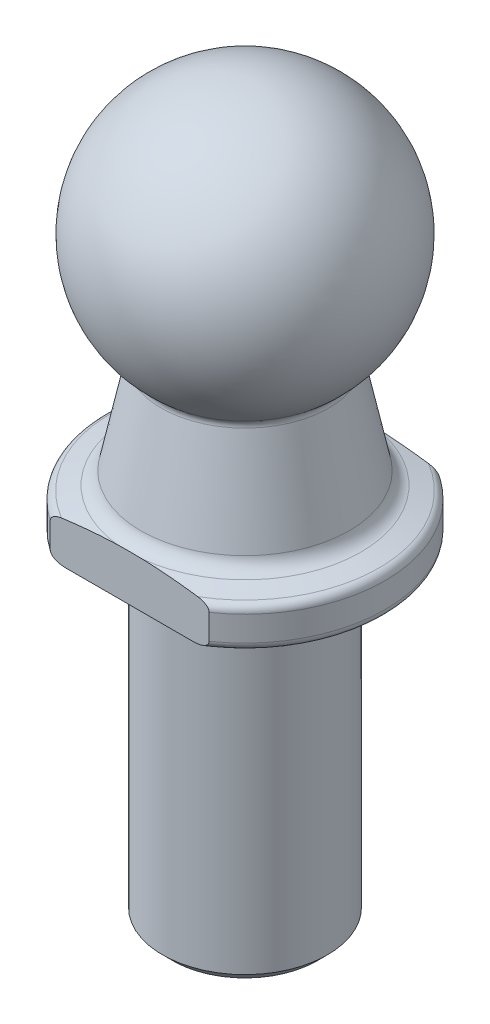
ISO-10303-21;
HEADER;
FILE_DESCRIPTION(('STEP AP214'),'2;1');
FILE_NAME('part.step','',(''),(''),'','','');
FILE_SCHEMA(('AUTOMOTIVE_DESIGN { 1 0 10303 214 1 1 1 1 }'));
ENDSEC;
DATA;
#1=APPLICATION_CONTEXT('core data for automotive mechanical design processes');
#2=APPLICATION_PROTOCOL_DEFINITION('international standard','automotive_design',2000,#1);
#3=PRODUCT_CONTEXT('',#1,'mechanical');
#4=PRODUCT('Part','Part','',(#3));
#5=PRODUCT_RELATED_PRODUCT_CATEGORY('part','',(#4));
#6=PRODUCT_DEFINITION_FORMATION('','',#4);
#7=PRODUCT_DEFINITION_CONTEXT('part definition',#1,'design');
#8=PRODUCT_DEFINITION('design','',#6,#7);
#9=PRODUCT_DEFINITION_SHAPE('','',#8);
#10=(LENGTH_UNIT() NAMED_UNIT(*) SI_UNIT(.MILLI.,.METRE.));
#11=(NAMED_UNIT(*) PLANE_ANGLE_UNIT() SI_UNIT($,.RADIAN.));
#12=(NAMED_UNIT(*) SI_UNIT($,.STERADIAN.) SOLID_ANGLE_UNIT());
#13=UNCERTAINTY_MEASURE_WITH_UNIT(LENGTH_MEASURE(1.E-05),#10,'distance_accuracy_value','');
#14=(GEOMETRIC_REPRESENTATION_CONTEXT(3) GLOBAL_UNCERTAINTY_ASSIGNED_CONTEXT((#13)) GLOBAL_UNIT_ASSIGNED_CONTEXT((#10,
#11,#12)) REPRESENTATION_CONTEXT('',''));
#15=CARTESIAN_POINT('',(0.,0.,0.));
#16=DIRECTION('',(0.,0.,1.));
#17=DIRECTION('',(1.,0.,0.));
#18=AXIS2_PLACEMENT_3D('',#15,#16,#17);
#19=CARTESIAN_POINT('',(-14.4441887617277,-15.5,0.));
#20=DIRECTION('',(0.,-1.,0.));
#21=DIRECTION('',(0.,0.,-1.));
#22=AXIS2_PLACEMENT_3D('',#19,#20,#21);
#23=TOROIDAL_SURFACE('',#22,8.,0.500000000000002);
#24=CARTESIAN_POINT('',(-14.4441887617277,-15.5,0.));
#25=DIRECTION('',(0.,-1.,0.));
#26=DIRECTION('',(0.,0.,-1.));
#27=AXIS2_PLACEMENT_3D('',#24,#25,#26);
#28=CIRCLE('',#27,8.5);
#29=CARTESIAN_POINT('',(-19.2660141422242,-15.5,7.));
#30=VERTEX_POINT('',#29);
#31=CARTESIAN_POINT('',(-19.2660141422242,-15.5,-7.));
#32=VERTEX_POINT('',#31);
#33=EDGE_CURVE('E144',#30,#32,#28,.T.);
#34=ORIENTED_EDGE('',*,*,#33,.T.);
#35=CARTESIAN_POINT('',(-19.2641184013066,-15.5327735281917,-7.));
#36=CARTESIAN_POINT('',(-19.2616922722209,-15.5536814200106,-7.));
#37=CARTESIAN_POINT('',(-19.2569431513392,-15.5743480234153,-7.));
#38=CARTESIAN_POINT('',(-19.2433901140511,-15.6143232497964,-7.));
#39=CARTESIAN_POINT('',(-19.2345724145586,-15.6336269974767,-7.));
#40=CARTESIAN_POINT('',(-19.2139094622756,-15.6701413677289,-7.));
#41=CARTESIAN_POINT('',(-19.2021086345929,-15.6873776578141,-7.));
#42=CARTESIAN_POINT('',(-19.1761999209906,-15.7199712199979,-7.));
#43=CARTESIAN_POINT('',(-19.1620926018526,-15.7353289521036,-7.));
#44=CARTESIAN_POINT('',(-19.1214783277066,-15.7746071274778,-7.));
#45=CARTESIAN_POINT('',(-19.093313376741,-15.7968060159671,-7.));
#46=CARTESIAN_POINT('',(-19.0339663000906,-15.8367351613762,-7.));
#47=CARTESIAN_POINT('',(-19.0027745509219,-15.8544504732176,-7.));
#48=CARTESIAN_POINT('',(-18.9425017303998,-15.8841464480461,-7.));
#49=CARTESIAN_POINT('',(-18.9136318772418,-15.8965641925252,-7.));
#50=CARTESIAN_POINT('',(-18.854927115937,-15.9188836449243,-7.));
#51=CARTESIAN_POINT('',(-18.8250914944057,-15.9287834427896,-7.));
#52=CARTESIAN_POINT('',(-18.7345511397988,-15.9552139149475,-7.));
#53=CARTESIAN_POINT('',(-18.6728769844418,-15.9684463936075,-7.));
#54=CARTESIAN_POINT('',(-18.5558555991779,-15.9867323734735,-7.));
#55=CARTESIAN_POINT('',(-18.500618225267,-15.9925653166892,-7.));
#56=CARTESIAN_POINT('',(-18.3898071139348,-15.9995243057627,-7.));
#57=CARTESIAN_POINT('',(-18.3342331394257,-16.0006465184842,-7.));
#58=CARTESIAN_POINT('',(-18.2231251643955,-15.9986639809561,-7.));
#59=CARTESIAN_POINT('',(-18.1675912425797,-15.9955554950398,-7.));
#60=CARTESIAN_POINT('',(-18.0569142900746,-15.9853780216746,-7.));
#61=CARTESIAN_POINT('',(-18.0017710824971,-15.978310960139,-7.));
#62=CARTESIAN_POINT('',(-17.905139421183,-15.9624125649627,-7.));
#63=CARTESIAN_POINT('',(-17.8635149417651,-15.9543974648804,-7.));
#64=CARTESIAN_POINT('',(-17.7807891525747,-15.9360203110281,-7.));
#65=CARTESIAN_POINT('',(-17.739687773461,-15.9256585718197,-7.));
#66=CARTESIAN_POINT('',(-17.6581841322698,-15.9023940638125,-7.));
#67=CARTESIAN_POINT('',(-17.6177821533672,-15.8894902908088,-7.));
#68=CARTESIAN_POINT('',(-17.5380532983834,-15.8607838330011,-7.));
#69=CARTESIAN_POINT('',(-17.4987255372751,-15.8449836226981,-7.));
#70=CARTESIAN_POINT('',(-17.4214821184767,-15.8097182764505,-7.));
#71=CARTESIAN_POINT('',(-17.3835729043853,-15.7902383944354,-7.));
#72=CARTESIAN_POINT('',(-17.3290263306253,-15.7573623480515,-7.));
#73=CARTESIAN_POINT('',(-17.3112709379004,-15.7458269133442,-7.));
#74=CARTESIAN_POINT('',(-17.2768414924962,-15.7212545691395,-7.));
#75=CARTESIAN_POINT('',(-17.2601659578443,-15.708219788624,-7.));
#76=CARTESIAN_POINT('',(-17.2334911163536,-15.6847185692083,-7.));
#77=CARTESIAN_POINT('',(-17.2230541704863,-15.6747522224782,-7.));
#78=CARTESIAN_POINT('',(-17.2032252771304,-15.6537856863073,-7.));
#79=CARTESIAN_POINT('',(-17.1938347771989,-15.6427841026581,-7.));
#80=CARTESIAN_POINT('',(-17.1764633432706,-15.6194937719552,-7.));
#81=CARTESIAN_POINT('',(-17.168500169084,-15.6071914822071,-7.));
#82=CARTESIAN_POINT('',(-17.1548215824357,-15.581394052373,-7.));
#83=CARTESIAN_POINT('',(-17.1490991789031,-15.5679027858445,-7.));
#84=CARTESIAN_POINT('',(-17.1418852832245,-15.5439811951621,-7.));
#85=CARTESIAN_POINT('',(-17.139652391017,-15.5337762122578,-7.));
#86=CARTESIAN_POINT('',(-17.1369558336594,-15.5131355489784,-7.));
#87=CARTESIAN_POINT('',(-17.1364906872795,-15.5027000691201,-7.));
#88=CARTESIAN_POINT('',(-17.1373815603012,-15.4819090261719,-7.));
#89=CARTESIAN_POINT('',(-17.1387376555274,-15.4715534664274,-7.));
#90=CARTESIAN_POINT('',(-17.1431212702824,-15.4512028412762,-7.));
#91=CARTESIAN_POINT('',(-17.1461504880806,-15.4412081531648,-7.));
#92=CARTESIAN_POINT('',(-17.1550572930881,-15.4179936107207,-7.));
#93=CARTESIAN_POINT('',(-17.1615838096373,-15.4050251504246,-7.));
#94=CARTESIAN_POINT('',(-17.1765806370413,-15.3802695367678,-7.));
#95=CARTESIAN_POINT('',(-17.1850559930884,-15.3684855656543,-7.));
#96=CARTESIAN_POINT('',(-17.2103646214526,-15.3374070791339,-7.));
#97=CARTESIAN_POINT('',(-17.2286212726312,-15.3192870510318,-7.));
#98=CARTESIAN_POINT('',(-17.2674248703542,-15.2857308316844,-7.));
#99=CARTESIAN_POINT('',(-17.287978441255,-15.2703027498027,-7.));
#100=CARTESIAN_POINT('',(-17.3332462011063,-15.2396486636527,-7.));
#101=CARTESIAN_POINT('',(-17.3581535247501,-15.2247110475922,-7.));
#102=CARTESIAN_POINT('',(-17.4091032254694,-15.1968948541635,-7.));
#103=CARTESIAN_POINT('',(-17.4351469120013,-15.1840187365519,-7.));
#104=CARTESIAN_POINT('',(-17.5145323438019,-15.1478505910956,-7.));
#105=CARTESIAN_POINT('',(-17.5690232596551,-15.1270837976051,-7.));
#106=CARTESIAN_POINT('',(-17.682492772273,-15.0897265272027,-7.));
#107=CARTESIAN_POINT('',(-17.7415574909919,-15.0734088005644,-7.));
#108=CARTESIAN_POINT('',(-17.8608874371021,-15.0456849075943,-7.));
#109=CARTESIAN_POINT('',(-17.9211538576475,-15.0342839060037,-7.));
#110=CARTESIAN_POINT('',(-18.0423450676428,-15.0162220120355,-7.));
#111=CARTESIAN_POINT('',(-18.1032693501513,-15.0095577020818,-7.));
#112=CARTESIAN_POINT('',(-18.2254120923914,-15.0011167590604,-7.));
#113=CARTESIAN_POINT('',(-18.2866302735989,-14.9993361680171,-7.));
#114=CARTESIAN_POINT('',(-18.4200194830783,-15.0012661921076,-7.));
#115=CARTESIAN_POINT('',(-18.4921802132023,-15.0060219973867,-7.));
#116=CARTESIAN_POINT('',(-18.6353674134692,-15.0243298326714,-7.));
#117=CARTESIAN_POINT('',(-18.7063957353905,-15.0378655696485,-7.));
#118=CARTESIAN_POINT('',(-18.8204190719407,-15.0692815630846,-7.));
#119=CARTESIAN_POINT('',(-18.8643189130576,-15.0838546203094,-7.));
#120=CARTESIAN_POINT('',(-18.9498684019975,-15.1186426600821,-7.));
#121=CARTESIAN_POINT('',(-18.9915213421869,-15.1388491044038,-7.));
#122=CARTESIAN_POINT('',(-19.0558580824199,-15.1774134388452,-7.));
#123=CARTESIAN_POINT('',(-19.0798127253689,-15.193639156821,-7.));
#124=CARTESIAN_POINT('',(-19.1252568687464,-15.2292711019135,-7.));
#125=CARTESIAN_POINT('',(-19.1467497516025,-15.2486728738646,-7.));
#126=CARTESIAN_POINT('',(-19.1806890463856,-15.2852770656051,-7.));
#127=CARTESIAN_POINT('',(-19.1940117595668,-15.3016608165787,-7.));
#128=CARTESIAN_POINT('',(-19.2179375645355,-15.3363212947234,-7.));
#129=CARTESIAN_POINT('',(-19.2285444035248,-15.3545953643,-7.));
#130=CARTESIAN_POINT('',(-19.244498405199,-15.3891192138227,-7.));
#131=CARTESIAN_POINT('',(-19.2504651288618,-15.4050809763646,-7.));
#132=CARTESIAN_POINT('',(-19.2596434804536,-15.4377714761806,-7.));
#133=CARTESIAN_POINT('',(-19.2628600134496,-15.4544987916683,-7.));
#134=CARTESIAN_POINT('',(-19.2656006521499,-15.4815724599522,-7.));
#135=CARTESIAN_POINT('',(-19.2660814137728,-15.4918293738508,-7.));
#136=CARTESIAN_POINT('',(-19.2659315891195,-15.5123344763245,-7.));
#137=CARTESIAN_POINT('',(-19.265300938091,-15.5225826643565,-7.));
#138=CARTESIAN_POINT('',(-19.2641184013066,-15.5327735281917,-7.));
#139=B_SPLINE_CURVE_WITH_KNOTS('',3,(#35,#36,#37,#38,#39,#40,#41,#42,#43,#44,#45,#46,#47,#48,
#49,#50,#51,#52,#53,#54,#55,#56,#57,#58,#59,#60,#61,#62,#63,#64,#65,#66,#67,#68,#69,#70,#71,#72,
#73,#74,#75,#76,#77,#78,#79,#80,#81,#82,#83,#84,#85,#86,#87,#88,#89,#90,#91,#92,#93,#94,#95,#96,
#97,#98,#99,#100,#101,#102,#103,#104,#105,#106,#107,#108,#109,#110,#111,#112,#113,#114,#115,
#116,#117,#118,#119,#120,#121,#122,#123,#124,#125,#126,#127,#128,#129,#130,#131,#132,#133,#134,
#135,#136,#137,#138),.UNSPECIFIED.,.T.,.F.,(4,2,2,2,2,2,2,2,2,2,2,2,2,2,2,2,2,2,2,2,2,2,2,2,2,2,
2,2,2,2,2,2,2,2,2,2,2,2,2,2,2,2,2,2,2,2,2,2,2,2,2,4),(0.,0.0630874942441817,0.126390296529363,
0.188800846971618,0.251196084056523,0.358169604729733,0.465495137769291,0.559640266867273,
0.653856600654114,0.842498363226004,1.00893364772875,1.17550433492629,1.34222219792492,
1.50885902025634,1.6359654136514,1.76305477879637,1.89019445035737,2.01722600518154,
2.144777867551,2.20824431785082,2.27162173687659,2.31485959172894,2.35815653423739,
2.40195958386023,2.44562486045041,2.47682780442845,2.5080045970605,2.53918268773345,
2.57039248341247,2.61369870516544,2.65711832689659,2.7338518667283,2.81081271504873,
2.8978037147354,2.98489774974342,3.15945379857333,3.34307100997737,3.52688063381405,
3.71055750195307,3.89408546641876,4.11062098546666,4.32675582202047,4.46525188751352,
4.60353917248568,4.69013689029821,4.77661415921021,4.83976237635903,4.9028229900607,
4.95373783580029,5.00456168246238,5.03530981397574,5.06605973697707),.UNSPECIFIED.);
#140=CARTESIAN_POINT('',(-18.3171721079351,-16.,-7.));
#141=VERTEX_POINT('',#140);
#142=EDGE_CURVE('E128',#32,#141,#139,.T.);
#143=ORIENTED_EDGE('',*,*,#142,.T.);
#144=CARTESIAN_POINT('',(-14.4441887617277,-16.,0.));
#145=DIRECTION('',(0.,-1.,0.));
#146=DIRECTION('',(0.,0.,-1.));
#147=AXIS2_PLACEMENT_3D('',#144,#145,#146);
#148=CIRCLE('',#147,8.);
#149=CARTESIAN_POINT('',(-18.3171721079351,-16.,7.));
#150=VERTEX_POINT('',#149);
#151=EDGE_CURVE('E138',#150,#141,#148,.T.);
#152=ORIENTED_EDGE('',*,*,#151,.F.);
#153=CARTESIAN_POINT('',(-19.1547769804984,-15.7422503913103,7.));
#154=CARTESIAN_POINT('',(-19.1687547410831,-15.7281596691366,7.));
#155=CARTESIAN_POINT('',(-19.181913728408,-15.7132489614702,7.));
#156=CARTESIAN_POINT('',(-19.2060502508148,-15.6817254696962,7.));
#157=CARTESIAN_POINT('',(-19.217027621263,-15.6651125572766,7.));
#158=CARTESIAN_POINT('',(-19.2362236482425,-15.6300858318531,7.));
#159=CARTESIAN_POINT('',(-19.244409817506,-15.611653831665,7.));
#160=CARTESIAN_POINT('',(-19.2570855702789,-15.5735607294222,7.));
#161=CARTESIAN_POINT('',(-19.261581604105,-15.5539018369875,7.));
#162=CARTESIAN_POINT('',(-19.266103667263,-15.516278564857,7.));
#163=CARTESIAN_POINT('',(-19.2665686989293,-15.4983669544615,7.));
#164=CARTESIAN_POINT('',(-19.2641281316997,-15.4627748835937,7.));
#165=CARTESIAN_POINT('',(-19.2612221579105,-15.4450944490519,7.));
#166=CARTESIAN_POINT('',(-19.2527560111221,-15.4122043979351,7.));
#167=CARTESIAN_POINT('',(-19.2474767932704,-15.3969203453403,7.));
#168=CARTESIAN_POINT('',(-19.234759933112,-15.3672899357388,7.));
#169=CARTESIAN_POINT('',(-19.2273217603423,-15.3529438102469,7.));
#170=CARTESIAN_POINT('',(-19.2062564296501,-15.3180100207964,7.));
#171=CARTESIAN_POINT('',(-19.1914379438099,-15.2981412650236,7.));
#172=CARTESIAN_POINT('',(-19.158854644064,-15.260984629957,7.));
#173=CARTESIAN_POINT('',(-19.1410818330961,-15.243704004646,7.));
#174=CARTESIAN_POINT('',(-19.0923433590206,-15.2020089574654,7.));
#175=CARTESIAN_POINT('',(-19.0598062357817,-15.1794444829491,7.));
#176=CARTESIAN_POINT('',(-18.991785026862,-15.1394005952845,7.));
#177=CARTESIAN_POINT('',(-18.9562950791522,-15.1219316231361,7.));
#178=CARTESIAN_POINT('',(-18.8874937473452,-15.092867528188,7.));
#179=CARTESIAN_POINT('',(-18.854360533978,-15.080841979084,7.));
#180=CARTESIAN_POINT('',(-18.7871795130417,-15.059662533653,7.));
#181=CARTESIAN_POINT('',(-18.753131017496,-15.0505108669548,7.));
#182=CARTESIAN_POINT('',(-18.6499734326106,-15.0267613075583,7.));
#183=CARTESIAN_POINT('',(-18.5799898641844,-15.015922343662,7.));
#184=CARTESIAN_POINT('',(-18.449775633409,-15.0032842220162,7.));
#185=CARTESIAN_POINT('',(-18.3896351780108,-15.0003842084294,7.));
#186=CARTESIAN_POINT('',(-18.2692741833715,-14.9996866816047,7.));
#187=CARTESIAN_POINT('',(-18.2090536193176,-15.0018934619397,7.));
#188=CARTESIAN_POINT('',(-18.0890878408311,-15.0109946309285,7.));
#189=CARTESIAN_POINT('',(-18.029341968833,-15.0178806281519,7.));
#190=CARTESIAN_POINT('',(-17.9105900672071,-15.0361995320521,7.));
#191=CARTESIAN_POINT('',(-17.8515835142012,-15.0476290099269,7.));
#192=CARTESIAN_POINT('',(-17.7496096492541,-15.0717280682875,7.));
#193=CARTESIAN_POINT('',(-17.7063914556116,-15.0833371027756,7.));
#194=CARTESIAN_POINT('',(-17.620830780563,-15.1094821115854,7.));
#195=CARTESIAN_POINT('',(-17.578488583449,-15.1240190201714,7.));
#196=CARTESIAN_POINT('',(-17.4911848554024,-15.158062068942,7.));
#197=CARTESIAN_POINT('',(-17.4463493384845,-15.1779060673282,7.));
#198=CARTESIAN_POINT('',(-17.3812221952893,-15.2118168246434,7.));
#199=CARTESIAN_POINT('',(-17.3598572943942,-15.2238182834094,7.));
#200=CARTESIAN_POINT('',(-17.3181855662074,-15.2495202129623,7.));
#201=CARTESIAN_POINT('',(-17.2978775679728,-15.2632187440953,7.));
#202=CARTESIAN_POINT('',(-17.2587049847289,-15.2928786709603,7.));
#203=CARTESIAN_POINT('',(-17.2398533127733,-15.3088573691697,7.));
#204=CARTESIAN_POINT('',(-17.2049555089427,-15.3436028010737,7.));
#205=CARTESIAN_POINT('',(-17.1888923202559,-15.3623511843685,7.));
#206=CARTESIAN_POINT('',(-17.1689058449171,-15.3924901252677,7.));
#207=CARTESIAN_POINT('',(-17.163036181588,-15.4025769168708,7.));
#208=CARTESIAN_POINT('',(-17.1528120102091,-15.4235032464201,7.));
#209=CARTESIAN_POINT('',(-17.1484566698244,-15.4343423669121,7.));
#210=CARTESIAN_POINT('',(-17.1416319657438,-15.4567488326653,7.));
#211=CARTESIAN_POINT('',(-17.1391841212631,-15.4683229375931,7.));
#212=CARTESIAN_POINT('',(-17.1365817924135,-15.4917242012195,7.));
#213=CARTESIAN_POINT('',(-17.1364248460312,-15.5035510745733,7.));
#214=CARTESIAN_POINT('',(-17.1383037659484,-15.5256608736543,7.));
#215=CARTESIAN_POINT('',(-17.1400919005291,-15.5359662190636,7.));
#216=CARTESIAN_POINT('',(-17.1452844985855,-15.5561596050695,7.));
#217=CARTESIAN_POINT('',(-17.1486903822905,-15.5660472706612,7.));
#218=CARTESIAN_POINT('',(-17.1586810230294,-15.589604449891,7.));
#219=CARTESIAN_POINT('',(-17.1660069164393,-15.6029567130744,7.));
#220=CARTESIAN_POINT('',(-17.1826304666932,-15.6283680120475,7.));
#221=CARTESIAN_POINT('',(-17.1919336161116,-15.6404233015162,7.));
#222=CARTESIAN_POINT('',(-17.220042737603,-15.6727518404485,7.));
#223=CARTESIAN_POINT('',(-17.2403901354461,-15.69166697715,7.));
#224=CARTESIAN_POINT('',(-17.2834271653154,-15.7265640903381,7.));
#225=CARTESIAN_POINT('',(-17.3061235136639,-15.742537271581,7.));
#226=CARTESIAN_POINT('',(-17.3564479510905,-15.7744761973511,7.));
#227=CARTESIAN_POINT('',(-17.3843041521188,-15.7900789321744,7.));
#228=CARTESIAN_POINT('',(-17.4411921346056,-15.8189941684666,7.));
#229=CARTESIAN_POINT('',(-17.4702252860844,-15.83230390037,7.));
#230=CARTESIAN_POINT('',(-17.55864134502,-15.869491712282,7.));
#231=CARTESIAN_POINT('',(-17.6192102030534,-15.8905528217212,7.));
#232=CARTESIAN_POINT('',(-17.7412952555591,-15.9266380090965,7.));
#233=CARTESIAN_POINT('',(-17.802792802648,-15.9417281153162,7.));
#234=CARTESIAN_POINT('',(-17.9268875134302,-15.9667882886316,7.));
#235=CARTESIAN_POINT('',(-17.9894857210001,-15.9767531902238,7.));
#236=CARTESIAN_POINT('',(-18.1151453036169,-15.9915894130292,7.));
#237=CARTESIAN_POINT('',(-18.1782053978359,-15.9964716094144,7.));
#238=CARTESIAN_POINT('',(-18.304467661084,-16.0008695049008,7.));
#239=CARTESIAN_POINT('',(-18.3676696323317,-16.0003904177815,7.));
#240=CARTESIAN_POINT('',(-18.4917839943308,-15.993521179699,7.));
#241=CARTESIAN_POINT('',(-18.5527061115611,-15.9873165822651,7.));
#242=CARTESIAN_POINT('',(-18.6735456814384,-15.9682457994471,7.));
#243=CARTESIAN_POINT('',(-18.7334635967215,-15.9553827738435,7.));
#244=CARTESIAN_POINT('',(-18.8366534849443,-15.9255145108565,7.));
#245=CARTESIAN_POINT('',(-18.8804315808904,-15.9102760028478,7.));
#246=CARTESIAN_POINT('',(-18.96551850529,-15.8739997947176,7.));
#247=CARTESIAN_POINT('',(-19.0068336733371,-15.8529778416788,7.));
#248=CARTESIAN_POINT('',(-19.0654842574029,-15.8159683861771,7.));
#249=CARTESIAN_POINT('',(-19.0845236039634,-15.8026795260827,7.));
#250=CARTESIAN_POINT('',(-19.121006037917,-15.7740493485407,7.));
#251=CARTESIAN_POINT('',(-19.1384500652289,-15.7587092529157,7.));
#252=CARTESIAN_POINT('',(-19.1547769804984,-15.7422503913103,7.));
#253=B_SPLINE_CURVE_WITH_KNOTS('',3,(#153,#154,#155,#156,#157,#158,#159,#160,#161,#162,#163,
#164,#165,#166,#167,#168,#169,#170,#171,#172,#173,#174,#175,#176,#177,#178,#179,#180,#181,#182,
#183,#184,#185,#186,#187,#188,#189,#190,#191,#192,#193,#194,#195,#196,#197,#198,#199,#200,#201,
#202,#203,#204,#205,#206,#207,#208,#209,#210,#211,#212,#213,#214,#215,#216,#217,#218,#219,#220,
#221,#222,#223,#224,#225,#226,#227,#228,#229,#230,#231,#232,#233,#234,#235,#236,#237,#238,#239,
#240,#241,#242,#243,#244,#245,#246,#247,#248,#249,#250,#251,#252),.UNSPECIFIED.,.T.,.F.,(4,2,2,
2,2,2,2,2,2,2,2,2,2,2,2,2,2,2,2,2,2,2,2,2,2,2,2,2,2,2,2,2,2,2,2,2,2,2,2,2,2,2,2,2,2,2,2,2,2,4),
(0.,0.0595036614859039,0.119011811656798,0.179190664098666,0.239264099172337,0.292700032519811,
0.346141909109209,0.394463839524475,0.442797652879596,0.516732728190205,0.590871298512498,
0.708993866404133,0.82735680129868,0.932947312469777,1.03861954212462,1.25040232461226,
1.43082740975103,1.61140424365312,1.79165809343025,1.97177616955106,2.10593565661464,
2.24013802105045,2.38690742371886,2.46036604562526,2.53374147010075,2.60770663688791,
2.68120207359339,2.71611776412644,2.75101423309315,2.78629890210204,2.82154564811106,
2.8527776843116,2.88403719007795,2.9294656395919,2.97502197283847,3.05789844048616,
3.1410187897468,3.23665037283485,3.332396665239,3.52433838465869,3.71409392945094,
3.90404034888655,4.0935795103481,4.2829343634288,4.46636024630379,4.64969916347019,
4.78847573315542,4.92687812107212,4.99642343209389,5.06592750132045),.UNSPECIFIED.);
#254=EDGE_CURVE('E201',#150,#30,#253,.T.);
#255=ORIENTED_EDGE('',*,*,#254,.T.);
#256=EDGE_LOOP('',(#34,#143,#152,#255));
#257=FACE_BOUND('',#256,.T.);
#258=ADVANCED_FACE('F35',(#257),#23,.T.);
#259=CARTESIAN_POINT('',(-14.4441887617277,8.,0.));
#260=DIRECTION('',(0.,-1.,0.));
#261=DIRECTION('',(0.,0.,-1.));
#262=AXIS2_PLACEMENT_3D('',#259,#260,#261);
#263=CYLINDRICAL_SURFACE('',#262,8.5);
#264=CARTESIAN_POINT('',(-14.4441887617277,-13.9836634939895,0.));
#265=DIRECTION('',(0.,-1.,0.));
#266=DIRECTION('',(0.,0.,-1.));
#267=AXIS2_PLACEMENT_3D('',#264,#265,#266);
#268=CIRCLE('',#267,8.5);
#269=CARTESIAN_POINT('',(-19.2660141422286,-13.9836634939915,7.));
#270=VERTEX_POINT('',#269);
#271=CARTESIAN_POINT('',(-19.2660141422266,-13.9836634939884,-7.));
#272=VERTEX_POINT('',#271);
#273=EDGE_CURVE('E257',#270,#272,#268,.T.);
#274=ORIENTED_EDGE('',*,*,#273,.T.);
#275=DIRECTION('',(0.,-1.,0.));
#276=VECTOR('',#275,1.);
#277=CARTESIAN_POINT('',(-19.2660141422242,8.,-7.));
#278=LINE('',#277,#276);
#279=EDGE_CURVE('E129',#272,#32,#278,.T.);
#280=ORIENTED_EDGE('',*,*,#279,.T.);
#281=ORIENTED_EDGE('',*,*,#33,.F.);
#282=DIRECTION('',(0.,-1.,0.));
#283=VECTOR('',#282,1.);
#284=CARTESIAN_POINT('',(-19.2660141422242,8.,7.));
#285=LINE('',#284,#283);
#286=EDGE_CURVE('E235',#30,#270,#285,.F.);
#287=ORIENTED_EDGE('',*,*,#286,.T.);
#288=EDGE_LOOP('',(#274,#280,#281,#287));
#289=FACE_BOUND('',#288,.T.);
#290=ADVANCED_FACE('F259',(#289),#263,.T.);
#291=CARTESIAN_POINT('',(-14.4441887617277,-13.9836634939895,0.));
#292=DIRECTION('',(0.,-1.,0.));
#293=DIRECTION('',(0.,0.,-1.));
#294=AXIS2_PLACEMENT_3D('',#291,#292,#293);
#295=TOROIDAL_SURFACE('',#294,8.,0.5);
#296=CARTESIAN_POINT('',(-14.4441887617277,-13.500700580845,0.));
#297=DIRECTION('',(0.,-1.,0.));
#298=DIRECTION('',(0.,0.,-1.));
#299=AXIS2_PLACEMENT_3D('',#296,#297,#298);
#300=CIRCLE('',#299,8.12940952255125);
#301=CARTESIAN_POINT('',(-18.5778674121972,-13.500700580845,7.));
#302=VERTEX_POINT('',#301);
#303=CARTESIAN_POINT('',(-18.5778674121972,-13.500700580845,-7.));
#304=VERTEX_POINT('',#303);
#305=EDGE_CURVE('E252',#302,#304,#300,.T.);
#306=ORIENTED_EDGE('',*,*,#305,.T.);
#307=CARTESIAN_POINT('',(-19.2642444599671,-13.9519970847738,-7.));
#308=CARTESIAN_POINT('',(-19.2663163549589,-13.9705250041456,-7.));
#309=CARTESIAN_POINT('',(-19.2665678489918,-13.9892640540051,-7.));
#310=CARTESIAN_POINT('',(-19.2633971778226,-14.0264295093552,-7.));
#311=CARTESIAN_POINT('',(-19.2599730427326,-14.0448557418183,-7.));
#312=CARTESIAN_POINT('',(-19.2498525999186,-14.0806227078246,-7.));
#313=CARTESIAN_POINT('',(-19.2431797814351,-14.0979702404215,-7.));
#314=CARTESIAN_POINT('',(-19.2271353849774,-14.1313566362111,-7.));
#315=CARTESIAN_POINT('',(-19.2177615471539,-14.147394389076,-7.));
#316=CARTESIAN_POINT('',(-19.1924506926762,-14.1845241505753,-7.));
#317=CARTESIAN_POINT('',(-19.1754179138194,-14.2048647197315,-7.));
#318=CARTESIAN_POINT('',(-19.1383998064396,-14.242639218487,-7.));
#319=CARTESIAN_POINT('',(-19.1184076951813,-14.2600662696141,-7.));
#320=CARTESIAN_POINT('',(-19.0631077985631,-14.3025128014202,-7.));
#321=CARTESIAN_POINT('',(-19.0261280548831,-14.3253377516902,-7.));
#322=CARTESIAN_POINT('',(-18.9492542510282,-14.3652968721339,-7.));
#323=CARTESIAN_POINT('',(-18.9093538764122,-14.3824182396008,-7.));
#324=CARTESIAN_POINT('',(-18.8319678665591,-14.4105123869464,-7.));
#325=CARTESIAN_POINT('',(-18.7946399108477,-14.4219288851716,-7.));
#326=CARTESIAN_POINT('',(-18.7191370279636,-14.441539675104,-7.));
#327=CARTESIAN_POINT('',(-18.6809614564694,-14.4497314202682,-7.));
#328=CARTESIAN_POINT('',(-18.5655364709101,-14.4701430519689,-7.));
#329=CARTESIAN_POINT('',(-18.4875297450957,-14.4781526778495,-7.));
#330=CARTESIAN_POINT('',(-18.3463618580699,-14.4844346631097,-7.));
#331=CARTESIAN_POINT('',(-18.2832472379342,-14.4842905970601,-7.));
#332=CARTESIAN_POINT('',(-18.1571924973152,-14.478705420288,-7.));
#333=CARTESIAN_POINT('',(-18.0942525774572,-14.4732596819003,-7.));
#334=CARTESIAN_POINT('',(-17.9690610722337,-14.4573435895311,-7.));
#335=CARTESIAN_POINT('',(-17.906809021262,-14.4468768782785,-7.));
#336=CARTESIAN_POINT('',(-17.7834479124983,-14.4208237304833,-7.));
#337=CARTESIAN_POINT('',(-17.722337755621,-14.4052425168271,-7.));
#338=CARTESIAN_POINT('',(-17.6031019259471,-14.3687201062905,-7.));
#339=CARTESIAN_POINT('',(-17.5449403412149,-14.3479012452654,-7.));
#340=CARTESIAN_POINT('',(-17.4599660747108,-14.3113171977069,-7.));
#341=CARTESIAN_POINT('',(-17.4320042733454,-14.2982210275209,-7.));
#342=CARTESIAN_POINT('',(-17.3772305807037,-14.2698312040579,-7.));
#343=CARTESIAN_POINT('',(-17.350417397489,-14.2545401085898,-7.));
#344=CARTESIAN_POINT('',(-17.2983268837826,-14.2209725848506,-7.));
#345=CARTESIAN_POINT('',(-17.2730677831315,-14.202667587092,-7.));
#346=CARTESIAN_POINT('',(-17.2259280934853,-14.1621834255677,-7.));
#347=CARTESIAN_POINT('',(-17.2040203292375,-14.1400389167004,-7.));
#348=CARTESIAN_POINT('',(-17.1783575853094,-14.1057209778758,-7.));
#349=CARTESIAN_POINT('',(-17.1717013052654,-14.0957448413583,-7.));
#350=CARTESIAN_POINT('',(-17.1597902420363,-14.0749701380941,-7.));
#351=CARTESIAN_POINT('',(-17.1545354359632,-14.0641715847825,-7.));
#352=CARTESIAN_POINT('',(-17.1458123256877,-14.0417035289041,-7.));
#353=CARTESIAN_POINT('',(-17.1423664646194,-14.0300250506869,-7.));
#354=CARTESIAN_POINT('',(-17.1377962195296,-14.0062254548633,-7.));
#355=CARTESIAN_POINT('',(-17.1366678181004,-13.9941051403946,-7.));
#356=CARTESIAN_POINT('',(-17.1368778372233,-13.9712128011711,-7.));
#357=CARTESIAN_POINT('',(-17.1379610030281,-13.9604376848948,-7.));
#358=CARTESIAN_POINT('',(-17.1419603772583,-13.9392327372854,-7.));
#359=CARTESIAN_POINT('',(-17.1448784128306,-13.9288032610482,-7.));
#360=CARTESIAN_POINT('',(-17.1533976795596,-13.9053858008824,-7.));
#361=CARTESIAN_POINT('',(-17.1595488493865,-13.8926006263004,-7.));
#362=CARTESIAN_POINT('',(-17.1737800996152,-13.8681586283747,-7.));
#363=CARTESIAN_POINT('',(-17.1818647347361,-13.8565045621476,-7.));
#364=CARTESIAN_POINT('',(-17.2058763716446,-13.8260178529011,-7.));
#365=CARTESIAN_POINT('',(-17.2231706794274,-13.808276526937,-7.));
#366=CARTESIAN_POINT('',(-17.2600254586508,-13.7753607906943,-7.));
#367=CARTESIAN_POINT('',(-17.2795926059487,-13.7601942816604,-7.));
#368=CARTESIAN_POINT('',(-17.3225236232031,-13.7301752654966,-7.));
#369=CARTESIAN_POINT('',(-17.3460621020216,-13.7155754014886,-7.));
#370=CARTESIAN_POINT('',(-17.3942533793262,-13.6883277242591,-7.));
#371=CARTESIAN_POINT('',(-17.4189074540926,-13.675682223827,-7.));
#372=CARTESIAN_POINT('',(-17.4940939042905,-13.6400791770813,-7.));
#373=CARTESIAN_POINT('',(-17.5457572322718,-13.6195146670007,-7.));
#374=CARTESIAN_POINT('',(-17.6548202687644,-13.581768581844,-7.));
#375=CARTESIAN_POINT('',(-17.7123511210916,-13.5649815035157,-7.));
#376=CARTESIAN_POINT('',(-17.8286507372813,-13.536182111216,-7.));
#377=CARTESIAN_POINT('',(-17.8874207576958,-13.5241749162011,-7.));
#378=CARTESIAN_POINT('',(-18.0057069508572,-13.5046962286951,-7.));
#379=CARTESIAN_POINT('',(-18.0652231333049,-13.4972247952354,-7.));
#380=CARTESIAN_POINT('',(-18.1846030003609,-13.4869103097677,-7.));
#381=CARTESIAN_POINT('',(-18.2444663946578,-13.4840638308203,-7.));
#382=CARTESIAN_POINT('',(-18.3823310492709,-13.4832306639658,-7.));
#383=CARTESIAN_POINT('',(-18.4603644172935,-13.4869660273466,-7.));
#384=CARTESIAN_POINT('',(-18.576463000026,-13.5000810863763,-7.));
#385=CARTESIAN_POINT('',(-18.6149692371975,-13.5056962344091,-7.));
#386=CARTESIAN_POINT('',(-18.6914559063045,-13.5197538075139,-7.));
#387=CARTESIAN_POINT('',(-18.7294365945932,-13.5281947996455,-7.));
#388=CARTESIAN_POINT('',(-18.8101055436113,-13.5498119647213,-7.));
#389=CARTESIAN_POINT('',(-18.8526587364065,-13.5635040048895,-7.));
#390=CARTESIAN_POINT('',(-18.9357977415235,-13.596052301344,-7.));
#391=CARTESIAN_POINT('',(-18.9763848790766,-13.6149050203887,-7.));
#392=CARTESIAN_POINT('',(-19.0420625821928,-13.6522211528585,-7.));
#393=CARTESIAN_POINT('',(-19.0680862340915,-13.6690283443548,-7.));
#394=CARTESIAN_POINT('',(-19.1174668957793,-13.7062145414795,-7.));
#395=CARTESIAN_POINT('',(-19.1408288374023,-13.7265867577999,-7.));
#396=CARTESIAN_POINT('',(-19.1766157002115,-13.7642121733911,-7.));
#397=CARTESIAN_POINT('',(-19.1901562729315,-13.7803974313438,-7.));
#398=CARTESIAN_POINT('',(-19.214599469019,-13.8146636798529,-7.));
#399=CARTESIAN_POINT('',(-19.2255056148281,-13.832742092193,-7.));
#400=CARTESIAN_POINT('',(-19.2423189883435,-13.8674375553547,-7.));
#401=CARTESIAN_POINT('',(-19.2487567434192,-13.8837949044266,-7.));
#402=CARTESIAN_POINT('',(-19.2587451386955,-13.9173722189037,-7.));
#403=CARTESIAN_POINT('',(-19.262298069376,-13.9345914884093,-7.));
#404=CARTESIAN_POINT('',(-19.2642444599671,-13.9519970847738,-7.));
#405=B_SPLINE_CURVE_WITH_KNOTS('',3,(#307,#308,#309,#310,#311,#312,#313,#314,#315,#316,#317,
#318,#319,#320,#321,#322,#323,#324,#325,#326,#327,#328,#329,#330,#331,#332,#333,#334,#335,#336,
#337,#338,#339,#340,#341,#342,#343,#344,#345,#346,#347,#348,#349,#350,#351,#352,#353,#354,#355,
#356,#357,#358,#359,#360,#361,#362,#363,#364,#365,#366,#367,#368,#369,#370,#371,#372,#373,#374,
#375,#376,#377,#378,#379,#380,#381,#382,#383,#384,#385,#386,#387,#388,#389,#390,#391,#392,#393,
#394,#395,#396,#397,#398,#399,#400,#401,#402,#403,#404),.UNSPECIFIED.,.T.,.F.,(4,2,2,2,2,2,2,2,
2,2,2,2,2,2,2,2,2,2,2,2,2,2,2,2,2,2,2,2,2,2,2,2,2,2,2,2,2,2,2,2,2,2,2,2,2,2,2,2,4),(0.,
0.0558495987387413,0.111729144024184,0.167210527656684,0.222738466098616,0.301883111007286,
0.38121204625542,0.510853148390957,0.640783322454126,0.757716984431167,0.874742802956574,
1.10923525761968,1.29837772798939,1.48768544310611,1.67685602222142,1.8658340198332,
2.05075231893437,2.14331548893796,2.23577165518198,2.32916085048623,2.42174727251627,
2.45764109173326,2.49353432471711,2.52986293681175,2.56612851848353,2.59844478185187,
2.63079327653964,2.67311721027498,2.71554184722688,2.78945190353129,2.86358481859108,
2.94654906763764,3.02961075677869,3.19606342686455,3.37563828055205,3.55540493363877,
3.73517392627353,3.91480965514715,4.14855291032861,4.26521178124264,4.38181158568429,
4.51566565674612,4.6494282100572,4.74213894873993,4.83467501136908,4.89778772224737,
4.96081557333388,5.01332383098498,5.06579035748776),.UNSPECIFIED.);
#406=EDGE_CURVE('E262',#304,#272,#405,.T.);
#407=ORIENTED_EDGE('',*,*,#406,.T.);
#408=ORIENTED_EDGE('',*,*,#273,.F.);
#409=CARTESIAN_POINT('',(-19.2634056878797,-13.9452285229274,7.));
#410=CARTESIAN_POINT('',(-19.2605286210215,-13.924097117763,7.));
#411=CARTESIAN_POINT('',(-19.255284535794,-13.9032659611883,7.));
#412=CARTESIAN_POINT('',(-19.2407230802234,-13.8630663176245,7.));
#413=CARTESIAN_POINT('',(-19.2313926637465,-13.8437027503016,7.));
#414=CARTESIAN_POINT('',(-19.2097363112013,-13.8071482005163,7.));
#415=CARTESIAN_POINT('',(-19.1974554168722,-13.789929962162,7.));
#416=CARTESIAN_POINT('',(-19.170619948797,-13.7574161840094,7.));
#417=CARTESIAN_POINT('',(-19.1560659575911,-13.7421201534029,7.));
#418=CARTESIAN_POINT('',(-19.1138729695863,-13.7026618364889,7.));
#419=CARTESIAN_POINT('',(-19.0845297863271,-13.6803291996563,7.));
#420=CARTESIAN_POINT('',(-19.02282576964,-13.6402961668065,7.));
#421=CARTESIAN_POINT('',(-18.990455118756,-13.6226116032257,7.));
#422=CARTESIAN_POINT('',(-18.927863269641,-13.593028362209,7.));
#423=CARTESIAN_POINT('',(-18.897845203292,-13.5806914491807,7.));
#424=CARTESIAN_POINT('',(-18.8368554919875,-13.5586297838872,7.));
#425=CARTESIAN_POINT('',(-18.8058831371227,-13.5489070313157,7.));
#426=CARTESIAN_POINT('',(-18.7119586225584,-13.5231304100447,7.));
#427=CARTESIAN_POINT('',(-18.6480610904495,-13.5104953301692,7.));
#428=CARTESIAN_POINT('',(-18.5273934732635,-13.4936406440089,7.));
#429=CARTESIAN_POINT('',(-18.470729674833,-13.488567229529,7.));
#430=CARTESIAN_POINT('',(-18.3571340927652,-13.483242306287,7.));
#431=CARTESIAN_POINT('',(-18.3002021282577,-13.4829947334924,7.));
#432=CARTESIAN_POINT('',(-18.1864156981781,-13.4868554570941,7.));
#433=CARTESIAN_POINT('',(-18.1295614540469,-13.4909698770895,7.));
#434=CARTESIAN_POINT('',(-18.0163448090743,-13.5033254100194,7.));
#435=CARTESIAN_POINT('',(-17.959982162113,-13.511564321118,7.));
#436=CARTESIAN_POINT('',(-17.8308185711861,-13.5353014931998,7.));
#437=CARTESIAN_POINT('',(-17.7582703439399,-13.5522503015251,7.));
#438=CARTESIAN_POINT('',(-17.6513185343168,-13.5835146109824,7.));
#439=CARTESIAN_POINT('',(-17.6160386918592,-13.5948850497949,7.));
#440=CARTESIAN_POINT('',(-17.5462766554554,-13.619842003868,7.));
#441=CARTESIAN_POINT('',(-17.5117940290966,-13.6334272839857,7.));
#442=CARTESIAN_POINT('',(-17.4526449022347,-13.659444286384,7.));
#443=CARTESIAN_POINT('',(-17.4277193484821,-13.6712854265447,7.));
#444=CARTESIAN_POINT('',(-17.378720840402,-13.6967674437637,7.));
#445=CARTESIAN_POINT('',(-17.3546498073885,-13.710412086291,7.));
#446=CARTESIAN_POINT('',(-17.3077000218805,-13.7400472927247,7.));
#447=CARTESIAN_POINT('',(-17.2848329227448,-13.7560565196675,7.));
#448=CARTESIAN_POINT('',(-17.2414786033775,-13.7910220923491,7.));
#449=CARTESIAN_POINT('',(-17.2209819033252,-13.8099659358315,7.));
#450=CARTESIAN_POINT('',(-17.1943172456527,-13.8404419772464,7.));
#451=CARTESIAN_POINT('',(-17.1864011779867,-13.85043146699,7.));
#452=CARTESIAN_POINT('',(-17.1718527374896,-13.8713286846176,7.));
#453=CARTESIAN_POINT('',(-17.1652207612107,-13.8822366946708,7.));
#454=CARTESIAN_POINT('',(-17.1536372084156,-13.9051176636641,7.));
#455=CARTESIAN_POINT('',(-17.1487090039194,-13.9171027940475,7.));
#456=CARTESIAN_POINT('',(-17.1412354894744,-13.9417900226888,7.));
#457=CARTESIAN_POINT('',(-17.1386841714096,-13.9544902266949,7.));
#458=CARTESIAN_POINT('',(-17.1364637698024,-13.9788616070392,7.));
#459=CARTESIAN_POINT('',(-17.1365317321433,-13.9905085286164,7.));
#460=CARTESIAN_POINT('',(-17.1388927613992,-14.0135768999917,7.));
#461=CARTESIAN_POINT('',(-17.141187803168,-14.0249981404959,7.));
#462=CARTESIAN_POINT('',(-17.148135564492,-14.0487036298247,7.));
#463=CARTESIAN_POINT('',(-17.1530554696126,-14.0609076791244,7.));
#464=CARTESIAN_POINT('',(-17.1647834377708,-14.0843660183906,7.));
#465=CARTESIAN_POINT('',(-17.1715950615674,-14.0956184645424,7.));
#466=CARTESIAN_POINT('',(-17.191463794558,-14.1241834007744,7.));
#467=CARTESIAN_POINT('',(-17.2056980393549,-14.1406659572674,7.));
#468=CARTESIAN_POINT('',(-17.2363483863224,-14.1714396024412,7.));
#469=CARTESIAN_POINT('',(-17.2527709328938,-14.1857239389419,7.));
#470=CARTESIAN_POINT('',(-17.2882535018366,-14.2135349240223,7.));
#471=CARTESIAN_POINT('',(-17.3074189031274,-14.2269252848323,7.));
#472=CARTESIAN_POINT('',(-17.346788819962,-14.2520955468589,7.));
#473=CARTESIAN_POINT('',(-17.3669944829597,-14.2638736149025,7.));
#474=CARTESIAN_POINT('',(-17.4287437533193,-14.2972715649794,7.));
#475=CARTESIAN_POINT('',(-17.4713555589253,-14.3169091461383,7.));
#476=CARTESIAN_POINT('',(-17.5645890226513,-14.3549066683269,7.));
#477=CARTESIAN_POINT('',(-17.6154572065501,-14.3726388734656,7.));
#478=CARTESIAN_POINT('',(-17.7185090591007,-14.4039230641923,7.));
#479=CARTESIAN_POINT('',(-17.770694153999,-14.4174702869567,7.));
#480=CARTESIAN_POINT('',(-17.8759823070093,-14.4408008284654,7.));
#481=CARTESIAN_POINT('',(-17.9290867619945,-14.450577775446,7.));
#482=CARTESIAN_POINT('',(-18.0358638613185,-14.4664594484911,7.));
#483=CARTESIAN_POINT('',(-18.0895367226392,-14.4725627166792,7.));
#484=CARTESIAN_POINT('',(-18.192712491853,-14.4806454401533,7.));
#485=CARTESIAN_POINT('',(-18.2421918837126,-14.482925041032,7.));
#486=CARTESIAN_POINT('',(-18.3411887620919,-14.4840990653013,7.));
#487=CARTESIAN_POINT('',(-18.390706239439,-14.4829941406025,7.));
#488=CARTESIAN_POINT('',(-18.489294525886,-14.4770630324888,7.));
#489=CARTESIAN_POINT('',(-18.538366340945,-14.4722542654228,7.));
#490=CARTESIAN_POINT('',(-18.6358904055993,-14.4584234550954,7.));
#491=CARTESIAN_POINT('',(-18.6843432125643,-14.4494055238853,7.));
#492=CARTESIAN_POINT('',(-18.7699608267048,-14.4288305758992,7.));
#493=CARTESIAN_POINT('',(-18.807348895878,-14.4182117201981,7.));
#494=CARTESIAN_POINT('',(-18.8809976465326,-14.3933302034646,7.));
#495=CARTESIAN_POINT('',(-18.9172562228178,-14.3790611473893,7.));
#496=CARTESIAN_POINT('',(-18.9881574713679,-14.3460239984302,7.));
#497=CARTESIAN_POINT('',(-19.0227795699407,-14.3272109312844,7.));
#498=CARTESIAN_POINT('',(-19.0885328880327,-14.2842418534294,7.));
#499=CARTESIAN_POINT('',(-19.1196773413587,-14.260107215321,7.));
#500=CARTESIAN_POINT('',(-19.1626202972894,-14.2184305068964,7.));
#501=CARTESIAN_POINT('',(-19.1766112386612,-14.203154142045,7.));
#502=CARTESIAN_POINT('',(-19.20230921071,-14.1707510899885,7.));
#503=CARTESIAN_POINT('',(-19.2140161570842,-14.1536243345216,7.));
#504=CARTESIAN_POINT('',(-19.2345187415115,-14.1173771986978,7.));
#505=CARTESIAN_POINT('',(-19.2432743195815,-14.0982336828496,7.));
#506=CARTESIAN_POINT('',(-19.2567776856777,-14.0585912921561,7.));
#507=CARTESIAN_POINT('',(-19.2615370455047,-14.0380965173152,7.));
#508=CARTESIAN_POINT('',(-19.2654390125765,-14.0053770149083,7.));
#509=CARTESIAN_POINT('',(-19.266105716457,-13.9933200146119,7.));
#510=CARTESIAN_POINT('',(-19.2659023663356,-13.9692195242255,7.));
#511=CARTESIAN_POINT('',(-19.2650323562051,-13.9571760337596,7.));
#512=CARTESIAN_POINT('',(-19.2634056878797,-13.9452285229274,7.));
#513=B_SPLINE_CURVE_WITH_KNOTS('',3,(#409,#410,#411,#412,#413,#414,#415,#416,#417,#418,#419,
#420,#421,#422,#423,#424,#425,#426,#427,#428,#429,#430,#431,#432,#433,#434,#435,#436,#437,#438,
#439,#440,#441,#442,#443,#444,#445,#446,#447,#448,#449,#450,#451,#452,#453,#454,#455,#456,#457,
#458,#459,#460,#461,#462,#463,#464,#465,#466,#467,#468,#469,#470,#471,#472,#473,#474,#475,#476,
#477,#478,#479,#480,#481,#482,#483,#484,#485,#486,#487,#488,#489,#490,#491,#492,#493,#494,#495,
#496,#497,#498,#499,#500,#501,#502,#503,#504,#505,#506,#507,#508,#509,#510,#511,#512),
.UNSPECIFIED.,.T.,.F.,(4,2,2,2,2,2,2,2,2,2,2,2,2,2,2,2,2,2,2,2,2,2,2,2,2,2,2,2,2,2,2,2,2,2,2,2,
2,2,2,2,2,2,2,2,2,2,2,2,2,2,2,4),(0.,0.0639108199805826,0.128027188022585,0.191220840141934,
0.254398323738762,0.364393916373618,0.474759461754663,0.571981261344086,0.669277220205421,
0.864070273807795,1.03454023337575,1.20514922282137,1.3759980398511,1.5467557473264,
1.76981503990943,1.88096349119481,1.9920501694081,2.07478366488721,2.15769270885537,
2.2412950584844,2.32455056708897,2.36271459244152,2.40089038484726,2.4395708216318,
2.47815321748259,2.51287340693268,2.54762441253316,2.58688266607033,2.62621532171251,
2.69118200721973,2.75634442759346,2.82637404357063,2.8964826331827,3.03693453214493,
3.19834120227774,3.35993089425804,3.5217924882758,3.68371827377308,3.83220866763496,
3.98067046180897,4.12843838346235,4.27606224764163,4.3925159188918,4.50917502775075,
4.62703983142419,4.74443961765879,4.80642245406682,4.86840757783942,4.93120302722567,
4.99381600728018,5.02995165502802,5.06608627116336),.UNSPECIFIED.);
#514=EDGE_CURVE('E192',#270,#302,#513,.T.);
#515=ORIENTED_EDGE('',*,*,#514,.T.);
#516=EDGE_LOOP('',(#306,#407,#408,#515));
#517=FACE_BOUND('',#516,.T.);
#518=ADVANCED_FACE('F261',(#517),#295,.T.);
#519=CARTESIAN_POINT('',(-14.4441887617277,-13.2083419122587,0.));
#520=DIRECTION('',(0.,-1.,0.));
#521=DIRECTION('',(0.,0.,-1.));
#522=AXIS2_PLACEMENT_3D('',#519,#520,#521);
#523=CONICAL_SURFACE('',#522,7.03831211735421,1.30899693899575);
#524=CARTESIAN_POINT('',(-10.3105101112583,-13.500700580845,-7.));
#525=VERTEX_POINT('',#524);
#526=CARTESIAN_POINT('',(-10.3105101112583,-13.500700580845,7.));
#527=VERTEX_POINT('',#526);
#528=EDGE_CURVE('E250',#525,#527,#300,.T.);
#529=ORIENTED_EDGE('',*,*,#528,.F.);
#530=CARTESIAN_POINT('',(3.24893507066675,-16.4208412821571,-7.));
#531=CARTESIAN_POINT('',(2.87210115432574,-16.3269569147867,-7.));
#532=CARTESIAN_POINT('',(2.49517463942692,-16.2334423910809,-7.));
#533=CARTESIAN_POINT('',(1.74109517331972,-16.0473238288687,-7.));
#534=CARTESIAN_POINT('',(1.36394222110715,-15.9547197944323,-7.));
#535=CARTESIAN_POINT('',(0.609341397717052,-15.7705863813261,-7.));
#536=CARTESIAN_POINT('',(0.231893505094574,-15.6790570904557,-7.));
#537=CARTESIAN_POINT('',(-0.523317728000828,-15.4973095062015,-7.));
#538=CARTESIAN_POINT('',(-0.901081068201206,-15.4070912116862,-7.));
#539=CARTESIAN_POINT('',(-1.66326544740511,-15.2267692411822,-7.));
#540=CARTESIAN_POINT('',(-2.04769283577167,-15.1366923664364,-7.));
#541=CARTESIAN_POINT('',(-2.81702165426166,-14.9585871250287,-7.));
#542=CARTESIAN_POINT('',(-3.2019230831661,-14.8705587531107,-7.));
#543=CARTESIAN_POINT('',(-3.97230814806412,-14.6970675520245,-7.));
#544=CARTESIAN_POINT('',(-4.35779178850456,-14.611604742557,-7.));
#545=CARTESIAN_POINT('',(-5.12946818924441,-14.4439307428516,-7.));
#546=CARTESIAN_POINT('',(-5.51566094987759,-14.3617195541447,-7.));
#547=CARTESIAN_POINT('',(-6.27493847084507,-14.2043602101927,-7.));
#548=CARTESIAN_POINT('',(-6.64799245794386,-14.1290641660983,-7.));
#549=CARTESIAN_POINT('',(-7.39507362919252,-13.9834292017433,-7.));
#550=CARTESIAN_POINT('',(-7.76910081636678,-13.9130902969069,-7.));
#551=CARTESIAN_POINT('',(-8.51839207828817,-13.7787747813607,-7.));
#552=CARTESIAN_POINT('',(-8.89365641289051,-13.7147996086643,-7.));
#553=CARTESIAN_POINT('',(-9.64550819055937,-13.5950450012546,-7.));
#554=CARTESIAN_POINT('',(-10.0220956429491,-13.5392656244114,-7.));
#555=CARTESIAN_POINT('',(-10.7734325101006,-13.4385461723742,-7.));
#556=CARTESIAN_POINT('',(-11.1481697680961,-13.3935167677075,-7.));
#557=CARTESIAN_POINT('',(-11.8989382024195,-13.3160614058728,-7.));
#558=CARTESIAN_POINT('',(-12.2749692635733,-13.2836343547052,-7.));
#559=CARTESIAN_POINT('',(-13.0277492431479,-13.2336000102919,-7.));
#560=CARTESIAN_POINT('',(-13.4044973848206,-13.2159813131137,-7.));
#561=CARTESIAN_POINT('',(-14.1584031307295,-13.1969463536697,-7.));
#562=CARTESIAN_POINT('',(-14.5355607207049,-13.1955295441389,-7.));
#563=CARTESIAN_POINT('',(-15.2641320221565,-13.2085560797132,-7.));
#564=CARTESIAN_POINT('',(-15.6155656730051,-13.2219357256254,-7.));
#565=CARTESIAN_POINT('',(-16.3176748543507,-13.2619133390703,-7.));
#566=CARTESIAN_POINT('',(-16.6683503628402,-13.2885116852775,-7.));
#567=CARTESIAN_POINT('',(-17.3688841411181,-13.3532948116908,-7.));
#568=CARTESIAN_POINT('',(-17.7187415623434,-13.3914885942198,-7.));
#569=CARTESIAN_POINT('',(-18.4172521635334,-13.4775322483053,-7.));
#570=CARTESIAN_POINT('',(-18.7659053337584,-13.5253821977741,-7.));
#571=CARTESIAN_POINT('',(-19.464929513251,-13.6293259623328,-7.));
#572=CARTESIAN_POINT('',(-19.8152907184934,-13.6854849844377,-7.));
#573=CARTESIAN_POINT('',(-20.5149317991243,-13.8041181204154,-7.));
#574=CARTESIAN_POINT('',(-20.8642116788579,-13.8665922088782,-7.));
#575=CARTESIAN_POINT('',(-21.5617268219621,-13.9965127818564,-7.));
#576=CARTESIAN_POINT('',(-21.9099623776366,-14.0639577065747,-7.));
#577=CARTESIAN_POINT('',(-22.6056407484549,-14.2027979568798,-7.));
#578=CARTESIAN_POINT('',(-22.9530835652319,-14.2741932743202,-7.));
#579=CARTESIAN_POINT('',(-23.6593894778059,-14.4226664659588,-7.));
#580=CARTESIAN_POINT('',(-24.0182291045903,-14.4998556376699,-7.));
#581=CARTESIAN_POINT('',(-24.7353187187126,-14.6569176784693,-7.));
#582=CARTESIAN_POINT('',(-25.0935687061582,-14.7367905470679,-7.));
#583=CARTESIAN_POINT('',(-26.1676354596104,-14.9796250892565,-7.));
#584=CARTESIAN_POINT('',(-26.882726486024,-15.1457936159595,-7.));
#585=CARTESIAN_POINT('',(-28.3012382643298,-15.4813384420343,-7.));
#586=CARTESIAN_POINT('',(-29.0046783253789,-15.6506336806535,-7.));
#587=CARTESIAN_POINT('',(-30.0590883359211,-15.9074474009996,-7.));
#588=CARTESIAN_POINT('',(-30.4104101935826,-15.9935246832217,-7.));
#589=CARTESIAN_POINT('',(-31.112850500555,-16.166499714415,-7.));
#590=CARTESIAN_POINT('',(-31.4639689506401,-16.2533974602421,-7.));
#591=CARTESIAN_POINT('',(-31.8150025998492,-16.3406357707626,-7.));
#592=B_SPLINE_CURVE_WITH_KNOTS('',3,(#530,#531,#532,#533,#534,#535,#536,#537,#538,#539,#540,
#541,#542,#543,#544,#545,#546,#547,#548,#549,#550,#551,#552,#553,#554,#555,#556,#557,#558,#559,
#560,#561,#562,#563,#564,#565,#566,#567,#568,#569,#570,#571,#572,#573,#574,#575,#576,#577,#578,
#579,#580,#581,#582,#583,#584,#585,#586,#587,#588,#589,#590,#591),.UNSPECIFIED.,.F.,.F.,(4,2,2,
2,2,2,2,2,2,2,2,2,2,2,2,2,2,2,2,2,2,2,2,2,2,2,2,2,2,2,4),(0.,1.16505955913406,2.33012432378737,
3.49528361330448,4.66044189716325,5.84495604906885,7.02946716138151,8.21398736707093,
9.39850813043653,10.5402131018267,11.6819216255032,12.8238875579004,13.9658615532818,
15.0979871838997,16.2300145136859,17.3611692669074,18.4922858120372,19.5470812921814,
20.6019069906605,21.6575537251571,22.7132089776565,23.777637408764,24.8420615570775,
25.9061531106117,26.9702424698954,28.0713727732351,29.1725028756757,31.3748935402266,
33.5454563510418,34.6305947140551,35.7157289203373),.UNSPECIFIED.);
#593=CARTESIAN_POINT('',(-13.7108147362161,-13.2083419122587,-7.));
#594=VERTEX_POINT('',#593);
#595=EDGE_CURVE('E266',#525,#594,#592,.T.);
#596=ORIENTED_EDGE('',*,*,#595,.T.);
#597=CARTESIAN_POINT('',(-14.4441887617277,-13.2083419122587,0.));
#598=DIRECTION('',(0.,-1.,0.));
#599=DIRECTION('',(0.,0.,-1.));
#600=AXIS2_PLACEMENT_3D('',#597,#598,#599);
#601=CIRCLE('',#600,7.03831211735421);
#602=CARTESIAN_POINT('',(-13.7108147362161,-13.2083419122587,7.));
#603=VERTEX_POINT('',#602);
#604=EDGE_CURVE('E61',#594,#603,#601,.T.);
#605=ORIENTED_EDGE('',*,*,#604,.T.);
#606=CARTESIAN_POINT('',(-29.7562747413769,-15.8336967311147,7.));
#607=CARTESIAN_POINT('',(-29.4042888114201,-15.7479297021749,7.));
#608=CARTESIAN_POINT('',(-29.05218852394,-15.6626286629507,7.));
#609=CARTESIAN_POINT('',(-28.3477066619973,-15.4931831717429,7.));
#610=CARTESIAN_POINT('',(-27.9953250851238,-15.4090387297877,7.));
#611=CARTESIAN_POINT('',(-27.290237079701,-15.2421332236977,7.));
#612=CARTESIAN_POINT('',(-26.9375306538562,-15.159372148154,7.));
#613=CARTESIAN_POINT('',(-26.2317267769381,-14.9955349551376,7.));
#614=CARTESIAN_POINT('',(-25.8786293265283,-14.9144588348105,7.));
#615=CARTESIAN_POINT('',(-25.1669710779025,-14.7532429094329,7.));
#616=CARTESIAN_POINT('',(-24.8084035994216,-14.6731325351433,7.));
#617=CARTESIAN_POINT('',(-24.0906883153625,-14.5155567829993,7.));
#618=CARTESIAN_POINT('',(-23.7315405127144,-14.4380913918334,7.));
#619=CARTESIAN_POINT('',(-23.0124739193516,-14.2864667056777,7.));
#620=CARTESIAN_POINT('',(-22.6525549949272,-14.2123080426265,7.));
#621=CARTESIAN_POINT('',(-21.9318718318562,-14.0681964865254,7.));
#622=CARTESIAN_POINT('',(-21.5711075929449,-13.9982435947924,7.));
#623=CARTESIAN_POINT('',(-20.8602338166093,-13.8658673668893,7.));
#624=CARTESIAN_POINT('',(-20.5101561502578,-13.8032738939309,7.));
#625=CARTESIAN_POINT('',(-19.8089134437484,-13.6844386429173,7.));
#626=CARTESIAN_POINT('',(-19.4577483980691,-13.6281968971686,7.));
#627=CARTESIAN_POINT('',(-18.7542993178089,-13.5237190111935,7.));
#628=CARTESIAN_POINT('',(-18.4020155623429,-13.4754810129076,7.));
#629=CARTESIAN_POINT('',(-17.6962189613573,-13.3888980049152,7.));
#630=CARTESIAN_POINT('',(-17.3427061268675,-13.3505529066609,7.));
#631=CARTESIAN_POINT('',(-16.636960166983,-13.2859553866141,7.));
#632=CARTESIAN_POINT('',(-16.2847344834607,-13.2596231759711,7.));
#633=CARTESIAN_POINT('',(-15.5795327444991,-13.2203407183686,7.));
#634=CARTESIAN_POINT('',(-15.2265567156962,-13.2073900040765,7.));
#635=CARTESIAN_POINT('',(-14.5204288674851,-13.195810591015,7.));
#636=CARTESIAN_POINT('',(-14.1672770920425,-13.1971792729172,7.));
#637=CARTESIAN_POINT('',(-13.4613163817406,-13.2141300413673,7.));
#638=CARTESIAN_POINT('',(-13.1085074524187,-13.229712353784,7.));
#639=CARTESIAN_POINT('',(-12.4387194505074,-13.2717787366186,7.));
#640=CARTESIAN_POINT('',(-12.1216605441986,-13.2970269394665,7.));
#641=CARTESIAN_POINT('',(-11.4884243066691,-13.3568830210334,7.));
#642=CARTESIAN_POINT('',(-11.1722470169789,-13.3914913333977,7.));
#643=CARTESIAN_POINT('',(-10.5407715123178,-13.4686635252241,7.));
#644=CARTESIAN_POINT('',(-10.2254736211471,-13.5112300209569,7.));
#645=CARTESIAN_POINT('',(-9.59584392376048,-13.6029393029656,7.));
#646=CARTESIAN_POINT('',(-9.28151211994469,-13.6520821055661,7.));
#647=CARTESIAN_POINT('',(-8.65165333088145,-13.7560762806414,7.));
#648=CARTESIAN_POINT('',(-8.3361322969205,-13.8109634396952,7.));
#649=CARTESIAN_POINT('',(-7.70589263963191,-13.9251378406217,7.));
#650=CARTESIAN_POINT('',(-7.39117401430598,-13.9844250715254,7.));
#651=CARTESIAN_POINT('',(-6.76249517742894,-14.106545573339,7.));
#652=CARTESIAN_POINT('',(-6.4485348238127,-14.1693781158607,7.));
#653=CARTESIAN_POINT('',(-5.82120584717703,-14.2979364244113,7.));
#654=CARTESIAN_POINT('',(-5.50783723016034,-14.3636622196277,7.));
#655=CARTESIAN_POINT('',(-4.54900927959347,-14.5685101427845,7.));
#656=CARTESIAN_POINT('',(-3.90436381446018,-14.7114381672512,7.));
#657=CARTESIAN_POINT('',(-2.61656150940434,-15.003948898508,7.));
#658=CARTESIAN_POINT('',(-1.97340475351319,-15.1535319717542,7.));
#659=CARTESIAN_POINT('',(-0.695236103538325,-15.455666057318,7.));
#660=CARTESIAN_POINT('',(-0.0602122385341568,-15.6081665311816,7.));
#661=CARTESIAN_POINT('',(0.891693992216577,-15.8393551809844,7.));
#662=CARTESIAN_POINT('',(1.20887462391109,-15.9168202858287,7.));
#663=CARTESIAN_POINT('',(1.8430616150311,-16.0724565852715,7.));
#664=CARTESIAN_POINT('',(2.16006797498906,-16.1506277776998,7.));
#665=CARTESIAN_POINT('',(2.47700043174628,-16.2290977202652,7.));
#666=B_SPLINE_CURVE_WITH_KNOTS('',3,(#606,#607,#608,#609,#610,#611,#612,#613,#614,#615,#616,
#617,#618,#619,#620,#621,#622,#623,#624,#625,#626,#627,#628,#629,#630,#631,#632,#633,#634,#635,
#636,#637,#638,#639,#640,#641,#642,#643,#644,#645,#646,#647,#648,#649,#650,#651,#652,#653,#654,
#655,#656,#657,#658,#659,#660,#661,#662,#663,#664,#665),.UNSPECIFIED.,.F.,.F.,(4,2,2,2,2,2,2,2,
2,2,2,2,2,2,2,2,2,2,2,2,2,2,2,2,2,2,2,2,2,4),(0.,1.08685443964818,2.17371829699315,
3.26057318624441,4.34742623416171,5.44964096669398,6.55185015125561,7.65426908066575,
8.75668835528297,9.82353121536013,10.8903795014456,11.9569797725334,13.0235704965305,
14.0829699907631,15.1423324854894,16.2015012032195,17.2606867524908,18.2147198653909,
19.1687971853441,20.1231887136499,21.0775826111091,22.0383228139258,22.999060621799,
23.9596017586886,24.9201525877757,26.9009906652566,28.8819379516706,30.8411608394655,
31.8206701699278,32.8001764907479),.UNSPECIFIED.);
#667=EDGE_CURVE('E180',#603,#527,#666,.T.);
#668=ORIENTED_EDGE('',*,*,#667,.T.);
#669=EDGE_LOOP('',(#529,#596,#605,#668));
#670=FACE_BOUND('',#669,.T.);
#671=ADVANCED_FACE('F282',(#670),#523,.T.);
#672=CARTESIAN_POINT('',(-14.4441887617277,0.00082519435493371,-0.11490182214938));
#673=DIRECTION('',(-1.,0.,0.));
#674=DIRECTION('',(0.,0.,-1.));
#675=AXIS2_PLACEMENT_3D('',#672,#673,#674);
#676=CIRCLE('',#675,8.);
#677=TRIMMED_CURVE('',#676,(PARAMETER_VALUE(-1.58515954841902)),
(PARAMETER_VALUE(1.58515954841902)),.T.,.PARAMETER.);
#678=CARTESIAN_POINT('',(-14.4441887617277,0.00082519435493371,0.));
#679=DIRECTION('',(0.,-1.,0.));
#680=AXIS1_PLACEMENT('',#678,#679);
#681=SURFACE_OF_REVOLUTION('',#677,#680);
#682=CARTESIAN_POINT('',(-14.4441887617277,-6.13136703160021,0.));
#683=DIRECTION('',(0.,-1.,0.));
#684=DIRECTION('',(0.,0.,-1.));
#685=AXIS2_PLACEMENT_3D('',#682,#683,#684);
#686=CIRCLE('',#685,5.25262685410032);
#687=CARTESIAN_POINT('',(-14.4441887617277,-6.13136703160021,-5.25262685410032));
#688=VERTEX_POINT('',#687);
#689=EDGE_CURVE('E300',#688,#688,#686,.T.);
#690=ORIENTED_EDGE('',*,*,#689,.F.);
#691=EDGE_LOOP('',(#690));
#692=FACE_BOUND('',#691,.T.);
#693=CARTESIAN_POINT('',(-14.4441887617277,8.,0.));
#694=VERTEX_POINT('',#693);
#695=VERTEX_LOOP('',#694);
#696=FACE_BOUND('',#695,.T.);
#697=ADVANCED_FACE('F37',(#692,#696),#681,.T.);
#698=CARTESIAN_POINT('',(-14.4441887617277,-36.,0.));
#699=DIRECTION('',(0.,1.,0.));
#700=DIRECTION('',(0.,0.,1.));
#701=AXIS2_PLACEMENT_3D('',#698,#699,#700);
#702=PLANE('',#701);
#703=CARTESIAN_POINT('',(-14.4441887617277,-36.,0.));
#704=DIRECTION('',(0.,-1.,0.));
#705=DIRECTION('',(0.,0.,-1.));
#706=AXIS2_PLACEMENT_3D('',#703,#704,#705);
#707=CIRCLE('',#706,4.4);
#708=CARTESIAN_POINT('',(-14.4441887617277,-36.,-4.4));
#709=VERTEX_POINT('',#708);
#710=EDGE_CURVE('E157',#709,#709,#707,.T.);
#711=ORIENTED_EDGE('',*,*,#710,.T.);
#712=EDGE_LOOP('',(#711));
#713=FACE_BOUND('',#712,.T.);
#714=ADVANCED_FACE('F292',(#713),#702,.F.);
#715=CARTESIAN_POINT('',(-14.4441887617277,-35.4,0.));
#716=DIRECTION('',(0.,1.,0.));
#717=DIRECTION('',(0.,0.,1.));
#718=AXIS2_PLACEMENT_3D('',#715,#716,#717);
#719=CONICAL_SURFACE('',#718,5.,0.78539816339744);
#720=ORIENTED_EDGE('',*,*,#710,.F.);
#721=EDGE_LOOP('',(#720));
#722=FACE_BOUND('',#721,.T.);
#723=CARTESIAN_POINT('',(-14.4441887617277,-35.4,0.));
#724=DIRECTION('',(0.,-1.,0.));
#725=DIRECTION('',(0.,0.,-1.));
#726=AXIS2_PLACEMENT_3D('',#723,#724,#725);
#727=CIRCLE('',#726,5.);
#728=CARTESIAN_POINT('',(-14.4441887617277,-35.4,-5.));
#729=VERTEX_POINT('',#728);
#730=EDGE_CURVE('E154',#729,#729,#727,.T.);
#731=ORIENTED_EDGE('',*,*,#730,.T.);
#732=EDGE_LOOP('',(#731));
#733=FACE_BOUND('',#732,.T.);
#734=ADVANCED_FACE('F351',(#722,#733),#719,.T.);
#735=CARTESIAN_POINT('',(-14.4441887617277,8.,0.));
#736=DIRECTION('',(0.,-1.,0.));
#737=DIRECTION('',(0.,0.,-1.));
#738=AXIS2_PLACEMENT_3D('',#735,#736,#737);
#739=CYLINDRICAL_SURFACE('',#738,5.);
#740=ORIENTED_EDGE('',*,*,#730,.F.);
#741=EDGE_LOOP('',(#740));
#742=FACE_BOUND('',#741,.T.);
#743=CARTESIAN_POINT('',(-14.4441887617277,-16.,0.));
#744=DIRECTION('',(0.,-1.,0.));
#745=DIRECTION('',(0.,0.,-1.));
#746=AXIS2_PLACEMENT_3D('',#743,#744,#745);
#747=CIRCLE('',#746,5.);
#748=CARTESIAN_POINT('',(-14.4441887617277,-16.,-5.));
#749=VERTEX_POINT('',#748);
#750=EDGE_CURVE('E146',#749,#749,#747,.T.);
#751=ORIENTED_EDGE('',*,*,#750,.T.);
#752=EDGE_LOOP('',(#751));
#753=FACE_BOUND('',#752,.T.);
#754=ADVANCED_FACE('F344',(#742,#753),#739,.T.);
#755=CARTESIAN_POINT('',(-22.4441887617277,-16.,0.));
#756=DIRECTION('',(0.,1.,0.));
#757=DIRECTION('',(0.,0.,1.));
#758=AXIS2_PLACEMENT_3D('',#755,#756,#757);
#759=PLANE('',#758);
#760=ORIENTED_EDGE('',*,*,#750,.F.);
#761=EDGE_LOOP('',(#760));
#762=FACE_BOUND('',#761,.T.);
#763=ORIENTED_EDGE('',*,*,#151,.T.);
#764=DIRECTION('',(-1.,0.,0.));
#765=VECTOR('',#764,1.);
#766=CARTESIAN_POINT('',(2.1599360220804,-16.,-7.));
#767=LINE('',#766,#765);
#768=CARTESIAN_POINT('',(-10.5712054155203,-16.,-7.));
#769=VERTEX_POINT('',#768);
#770=EDGE_CURVE('E121',#769,#141,#767,.T.);
#771=ORIENTED_EDGE('',*,*,#770,.F.);
#772=CARTESIAN_POINT('',(-10.5712054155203,-16.,7.));
#773=VERTEX_POINT('',#772);
#774=EDGE_CURVE('E135',#769,#773,#148,.T.);
#775=ORIENTED_EDGE('',*,*,#774,.T.);
#776=DIRECTION('',(1.,0.,0.));
#777=VECTOR('',#776,1.);
#778=CARTESIAN_POINT('',(-20.9644950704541,-16.,7.));
#779=LINE('',#778,#777);
#780=EDGE_CURVE('E222',#150,#773,#779,.T.);
#781=ORIENTED_EDGE('',*,*,#780,.F.);
#782=EDGE_LOOP('',(#763,#771,#775,#781));
#783=FACE_BOUND('',#782,.T.);
#784=ADVANCED_FACE('F133',(#762,#783),#759,.F.);
#785=ORIENTED_EDGE('',*,*,#774,.F.);
#786=CARTESIAN_POINT('',(-11.7008822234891,-15.365752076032,-7.));
#787=CARTESIAN_POINT('',(-11.7087702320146,-15.3760823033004,-7.));
#788=CARTESIAN_POINT('',(-11.7160658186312,-15.3868695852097,-7.));
#789=CARTESIAN_POINT('',(-11.7290025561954,-15.4094023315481,-7.));
#790=CARTESIAN_POINT('',(-11.7346462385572,-15.421146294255,-7.));
#791=CARTESIAN_POINT('',(-11.7429097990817,-15.4432808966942,-7.));
#792=CARTESIAN_POINT('',(-11.7458911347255,-15.4535345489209,-7.));
#793=CARTESIAN_POINT('',(-11.7500829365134,-15.4743975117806,-7.));
#794=CARTESIAN_POINT('',(-11.7512952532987,-15.4850064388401,-7.));
#795=CARTESIAN_POINT('',(-11.7518121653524,-15.5062984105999,-7.));
#796=CARTESIAN_POINT('',(-11.7511120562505,-15.5169815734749,-7.));
#797=CARTESIAN_POINT('',(-11.7478785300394,-15.5380667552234,-7.));
#798=CARTESIAN_POINT('',(-11.745343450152,-15.5484685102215,-7.));
#799=CARTESIAN_POINT('',(-11.7377911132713,-15.5715130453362,-7.));
#800=CARTESIAN_POINT('',(-11.7322855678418,-15.5839936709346,-7.));
#801=CARTESIAN_POINT('',(-11.7193657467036,-15.6079201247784,-7.));
#802=CARTESIAN_POINT('',(-11.7119471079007,-15.6193635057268,-7.));
#803=CARTESIAN_POINT('',(-11.6901266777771,-15.648841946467,-7.));
#804=CARTESIAN_POINT('',(-11.6744567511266,-15.6659258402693,-7.));
#805=CARTESIAN_POINT('',(-11.6408950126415,-15.6977240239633,-7.));
#806=CARTESIAN_POINT('',(-11.6229966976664,-15.7124310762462,-7.));
#807=CARTESIAN_POINT('',(-11.5840208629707,-15.7413126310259,-7.));
#808=CARTESIAN_POINT('',(-11.5628034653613,-15.7552959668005,-7.));
#809=CARTESIAN_POINT('',(-11.5192924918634,-15.7814918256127,-7.));
#810=CARTESIAN_POINT('',(-11.4969977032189,-15.793702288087,-7.));
#811=CARTESIAN_POINT('',(-11.4289382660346,-15.8282124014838,-7.));
#812=CARTESIAN_POINT('',(-11.3820750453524,-15.8483389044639,-7.));
#813=CARTESIAN_POINT('',(-11.2810807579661,-15.8864179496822,-7.));
#814=CARTESIAN_POINT('',(-11.226750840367,-15.9038225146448,-7.));
#815=CARTESIAN_POINT('',(-11.1168034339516,-15.9341438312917,-7.));
#816=CARTESIAN_POINT('',(-11.0611845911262,-15.9470556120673,-7.));
#817=CARTESIAN_POINT('',(-10.9491028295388,-15.9687320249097,-7.));
#818=CARTESIAN_POINT('',(-10.8926392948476,-15.9774934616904,-7.));
#819=CARTESIAN_POINT('',(-10.779223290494,-15.9908800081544,-7.));
#820=CARTESIAN_POINT('',(-10.7222706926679,-15.995503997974,-7.));
#821=CARTESIAN_POINT('',(-10.5765630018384,-16.0017838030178,-7.));
#822=CARTESIAN_POINT('',(-10.4876278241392,-16.0003867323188,-7.));
#823=CARTESIAN_POINT('',(-10.3552174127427,-15.9889940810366,-7.));
#824=CARTESIAN_POINT('',(-10.3113149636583,-15.9836628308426,-7.));
#825=CARTESIAN_POINT('',(-10.2240914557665,-15.9694805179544,-7.));
#826=CARTESIAN_POINT('',(-10.1807699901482,-15.9606320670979,-7.));
#827=CARTESIAN_POINT('',(-10.0976469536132,-15.9394730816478,-7.));
#828=CARTESIAN_POINT('',(-10.0577873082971,-15.9273941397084,-7.));
#829=CARTESIAN_POINT('',(-9.97956155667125,-15.8989035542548,-7.));
#830=CARTESIAN_POINT('',(-9.94119653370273,-15.8824888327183,-7.));
#831=CARTESIAN_POINT('',(-9.87288155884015,-15.8473700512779,-7.));
#832=CARTESIAN_POINT('',(-9.84255021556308,-15.8294177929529,-7.));
#833=CARTESIAN_POINT('',(-9.7849916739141,-15.7890630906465,-7.));
#834=CARTESIAN_POINT('',(-9.75775581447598,-15.766673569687,-7.));
#835=CARTESIAN_POINT('',(-9.71841656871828,-15.726899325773,-7.));
#836=CARTESIAN_POINT('',(-9.70465330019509,-15.7111627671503,-7.));
#837=CARTESIAN_POINT('',(-9.6795929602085,-15.6778215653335,-7.));
#838=CARTESIAN_POINT('',(-9.6682928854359,-15.6602192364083,-7.));
#839=CARTESIAN_POINT('',(-9.65052554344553,-15.626300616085,-7.));
#840=CARTESIAN_POINT('',(-9.64357082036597,-15.6102421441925,-7.));
#841=CARTESIAN_POINT('',(-9.63243061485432,-15.57718642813,-7.));
#842=CARTESIAN_POINT('',(-9.62824289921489,-15.5601899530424,-7.));
#843=CARTESIAN_POINT('',(-9.62298726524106,-15.5256187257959,-7.));
#844=CARTESIAN_POINT('',(-9.62193604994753,-15.5080413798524,-7.));
#845=CARTESIAN_POINT('',(-9.62310765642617,-15.472996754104,-7.));
#846=CARTESIAN_POINT('',(-9.62533062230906,-15.4555294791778,-7.));
#847=CARTESIAN_POINT('',(-9.63251926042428,-15.4226982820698,-7.));
#848=CARTESIAN_POINT('',(-9.63724292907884,-15.4072798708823,-7.));
#849=CARTESIAN_POINT('',(-9.6489237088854,-15.3773230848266,-7.));
#850=CARTESIAN_POINT('',(-9.65588163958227,-15.3627850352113,-7.));
#851=CARTESIAN_POINT('',(-9.67544009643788,-15.3280256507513,-7.));
#852=CARTESIAN_POINT('',(-9.68914583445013,-15.3084269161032,-7.));
#853=CARTESIAN_POINT('',(-9.71948808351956,-15.2716476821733,-7.));
#854=CARTESIAN_POINT('',(-9.73613199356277,-15.2544734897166,-7.));
#855=CARTESIAN_POINT('',(-9.78159152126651,-15.2132414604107,-7.));
#856=CARTESIAN_POINT('',(-9.81192296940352,-15.1908667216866,-7.));
#857=CARTESIAN_POINT('',(-9.87554934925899,-15.1508958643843,-7.));
#858=CARTESIAN_POINT('',(-9.90885046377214,-15.1333100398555,-7.));
#859=CARTESIAN_POINT('',(-9.97335643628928,-15.1039015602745,-7.));
#860=CARTESIAN_POINT('',(-10.0043702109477,-15.0916513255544,-7.));
#861=CARTESIAN_POINT('',(-10.0673398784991,-15.0698458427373,-7.));
#862=CARTESIAN_POINT('',(-10.0992964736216,-15.0602926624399,-7.));
#863=CARTESIAN_POINT('',(-10.1961955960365,-15.0351188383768,-7.));
#864=CARTESIAN_POINT('',(-10.2620628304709,-15.0230279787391,-7.));
#865=CARTESIAN_POINT('',(-10.3859213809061,-15.007468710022,-7.));
#866=CARTESIAN_POINT('',(-10.4438106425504,-15.003076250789,-7.));
#867=CARTESIAN_POINT('',(-10.5597980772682,-14.9992150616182,-7.));
#868=CARTESIAN_POINT('',(-10.6178963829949,-14.9997503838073,-7.));
#869=CARTESIAN_POINT('',(-10.733849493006,-15.0052912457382,-7.));
#870=CARTESIAN_POINT('',(-10.7917043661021,-15.0102954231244,-7.));
#871=CARTESIAN_POINT('',(-10.9068526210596,-15.0245601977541,-7.));
#872=CARTESIAN_POINT('',(-10.9641463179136,-15.0338182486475,-7.));
#873=CARTESIAN_POINT('',(-11.0811865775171,-15.0573126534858,-7.));
#874=CARTESIAN_POINT('',(-11.1408814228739,-15.0718077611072,-7.));
#875=CARTESIAN_POINT('',(-11.2587072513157,-15.106109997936,-7.));
#876=CARTESIAN_POINT('',(-11.3168399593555,-15.1259109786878,-7.));
#877=CARTESIAN_POINT('',(-11.4126977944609,-15.1650016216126,-7.));
#878=CARTESIAN_POINT('',(-11.4511398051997,-15.1825297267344,-7.));
#879=CARTESIAN_POINT('',(-11.5259582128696,-15.2217388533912,-7.));
#880=CARTESIAN_POINT('',(-11.5623352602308,-15.2434185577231,-7.));
#881=CARTESIAN_POINT('',(-11.6160050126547,-15.2820661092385,-7.));
#882=CARTESIAN_POINT('',(-11.6347407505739,-15.2970092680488,-7.));
#883=CARTESIAN_POINT('',(-11.6699380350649,-15.3293787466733,-7.));
#884=CARTESIAN_POINT('',(-11.6864075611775,-15.3467958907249,-7.));
#885=CARTESIAN_POINT('',(-11.7008822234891,-15.365752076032,-7.));
#886=B_SPLINE_CURVE_WITH_KNOTS('',3,(#786,#787,#788,#789,#790,#791,#792,#793,#794,#795,#796,
#797,#798,#799,#800,#801,#802,#803,#804,#805,#806,#807,#808,#809,#810,#811,#812,#813,#814,#815,
#816,#817,#818,#819,#820,#821,#822,#823,#824,#825,#826,#827,#828,#829,#830,#831,#832,#833,#834,
#835,#836,#837,#838,#839,#840,#841,#842,#843,#844,#845,#846,#847,#848,#849,#850,#851,#852,#853,
#854,#855,#856,#857,#858,#859,#860,#861,#862,#863,#864,#865,#866,#867,#868,#869,#870,#871,#872,
#873,#874,#875,#876,#877,#878,#879,#880,#881,#882,#883,#884,#885),.UNSPECIFIED.,.T.,.F.,(4,2,2,
2,2,2,2,2,2,2,2,2,2,2,2,2,2,2,2,2,2,2,2,2,2,2,2,2,2,2,2,2,2,2,2,2,2,2,2,2,2,2,2,2,2,2,2,2,2,4),
(0.,0.0389653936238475,0.0778707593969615,0.109772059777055,0.141639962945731,0.173586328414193,
0.205561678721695,0.246254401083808,0.287040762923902,0.356195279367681,0.4255565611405,
0.501669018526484,0.577869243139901,0.730544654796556,0.901481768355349,1.07260741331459,
1.24386459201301,1.41516811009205,1.68114794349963,1.8137173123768,1.94618841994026,
2.07094594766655,2.19579228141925,2.30124363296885,2.40639226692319,2.46893435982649,
2.53139976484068,2.58368657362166,2.63593113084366,2.68845341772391,2.74097801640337,
2.78915919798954,2.83735807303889,2.90869829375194,2.98022079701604,3.09266213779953,
3.20534330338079,3.30523484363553,3.40520276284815,3.60547562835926,3.77943924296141,
3.95354592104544,4.12759953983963,4.30154910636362,4.48563929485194,4.66951707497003,
4.79612471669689,4.92269225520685,4.9944541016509,5.06595642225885),.UNSPECIFIED.);
#887=CARTESIAN_POINT('',(-9.62236338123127,-15.5,-7.));
#888=VERTEX_POINT('',#887);
#889=EDGE_CURVE('E118',#769,#888,#886,.T.);
#890=ORIENTED_EDGE('',*,*,#889,.T.);
#891=CARTESIAN_POINT('',(-9.62236338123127,-15.5,7.));
#892=VERTEX_POINT('',#891);
#893=EDGE_CURVE('E148',#888,#892,#28,.T.);
#894=ORIENTED_EDGE('',*,*,#893,.T.);
#895=CARTESIAN_POINT('',(-11.6944429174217,-15.3575830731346,7.));
#896=CARTESIAN_POINT('',(-11.6831361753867,-15.3436700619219,7.));
#897=CARTESIAN_POINT('',(-11.6707966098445,-15.3306116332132,7.));
#898=CARTESIAN_POINT('',(-11.6447484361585,-15.3059216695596,7.));
#899=CARTESIAN_POINT('',(-11.6310369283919,-15.2942932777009,7.));
#900=CARTESIAN_POINT('',(-11.5883735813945,-15.261061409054,7.));
#901=CARTESIAN_POINT('',(-11.5580301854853,-15.2412604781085,7.));
#902=CARTESIAN_POINT('',(-11.4892150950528,-15.2014564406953,7.));
#903=CARTESIAN_POINT('',(-11.4503301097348,-15.1822023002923,7.));
#904=CARTESIAN_POINT('',(-11.3709290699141,-15.1472759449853,7.));
#905=CARTESIAN_POINT('',(-11.3304101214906,-15.131610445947,7.));
#906=CARTESIAN_POINT('',(-11.2483153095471,-15.1032277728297,7.));
#907=CARTESIAN_POINT('',(-11.2067382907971,-15.0905139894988,7.));
#908=CARTESIAN_POINT('',(-11.122869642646,-15.0676994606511,7.));
#909=CARTESIAN_POINT('',(-11.0805778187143,-15.0575994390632,7.));
#910=CARTESIAN_POINT('',(-10.9757731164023,-15.0357210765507,7.));
#911=CARTESIAN_POINT('',(-10.9129668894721,-15.0253319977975,7.));
#912=CARTESIAN_POINT('',(-10.7866666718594,-15.0096571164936,7.));
#913=CARTESIAN_POINT('',(-10.7231721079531,-15.0043759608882,7.));
#914=CARTESIAN_POINT('',(-10.5962823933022,-14.9992394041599,7.));
#915=CARTESIAN_POINT('',(-10.5328884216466,-14.9993561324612,7.));
#916=CARTESIAN_POINT('',(-10.4064406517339,-15.0055860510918,7.));
#917=CARTESIAN_POINT('',(-10.3433865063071,-15.0116910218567,7.));
#918=CARTESIAN_POINT('',(-10.2389516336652,-15.0278128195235,7.));
#919=CARTESIAN_POINT('',(-10.1972701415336,-15.0358799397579,7.));
#920=CARTESIAN_POINT('',(-10.1147278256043,-15.0557229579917,7.));
#921=CARTESIAN_POINT('',(-10.0738678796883,-15.0675026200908,7.));
#922=CARTESIAN_POINT('',(-9.99334648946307,-15.0955565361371,7.));
#923=CARTESIAN_POINT('',(-9.95369644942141,-15.1118641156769,7.));
#924=CARTESIAN_POINT('',(-9.87708293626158,-15.1498920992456,7.));
#925=CARTESIAN_POINT('',(-9.8401122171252,-15.1715971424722,7.));
#926=CARTESIAN_POINT('',(-9.78646312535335,-15.2104301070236,7.));
#927=CARTESIAN_POINT('',(-9.76811811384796,-15.2252474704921,7.));
#928=CARTESIAN_POINT('',(-9.73345606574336,-15.2571554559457,7.));
#929=CARTESIAN_POINT('',(-9.71714051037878,-15.2742477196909,7.));
#930=CARTESIAN_POINT('',(-9.68718524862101,-15.3110879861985,7.));
#931=CARTESIAN_POINT('',(-9.67358663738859,-15.3308701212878,7.));
#932=CARTESIAN_POINT('',(-9.65057564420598,-15.3727318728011,7.));
#933=CARTESIAN_POINT('',(-9.64114894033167,-15.3948033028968,7.));
#934=CARTESIAN_POINT('',(-9.62980290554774,-15.4332713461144,7.));
#935=CARTESIAN_POINT('',(-9.62645095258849,-15.449248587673,7.));
#936=CARTESIAN_POINT('',(-9.62250347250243,-15.4815414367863,7.));
#937=CARTESIAN_POINT('',(-9.62190638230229,-15.4978568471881,7.));
#938=CARTESIAN_POINT('',(-9.62352145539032,-15.5303428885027,7.));
#939=CARTESIAN_POINT('',(-9.62573327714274,-15.5465135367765,7.));
#940=CARTESIAN_POINT('',(-9.63277862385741,-15.5782711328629,7.));
#941=CARTESIAN_POINT('',(-9.63761388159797,-15.5938576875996,7.));
#942=CARTESIAN_POINT('',(-9.65118150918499,-15.6282118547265,7.));
#943=CARTESIAN_POINT('',(-9.66061365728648,-15.6467018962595,7.));
#944=CARTESIAN_POINT('',(-9.68234775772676,-15.6819038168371,7.));
#945=CARTESIAN_POINT('',(-9.69465493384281,-15.6986123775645,7.));
#946=CARTESIAN_POINT('',(-9.72774606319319,-15.7376811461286,7.));
#947=CARTESIAN_POINT('',(-9.7497846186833,-15.7589717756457,7.));
#948=CARTESIAN_POINT('',(-9.79683515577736,-15.7979269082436,7.));
#949=CARTESIAN_POINT('',(-9.82185352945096,-15.8155833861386,7.));
#950=CARTESIAN_POINT('',(-9.89207624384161,-15.8590754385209,7.));
#951=CARTESIAN_POINT('',(-9.93910859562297,-15.8819366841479,7.));
#952=CARTESIAN_POINT('',(-10.0359568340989,-15.9206020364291,7.));
#953=CARTESIAN_POINT('',(-10.0857796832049,-15.9363875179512,7.));
#954=CARTESIAN_POINT('',(-10.1819592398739,-15.9609911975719,7.));
#955=CARTESIAN_POINT('',(-10.2281849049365,-15.9703357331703,7.));
#956=CARTESIAN_POINT('',(-10.3212827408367,-15.9850630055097,7.));
#957=CARTESIAN_POINT('',(-10.3681554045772,-15.9904425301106,7.));
#958=CARTESIAN_POINT('',(-10.4621916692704,-15.9977239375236,7.));
#959=CARTESIAN_POINT('',(-10.5093554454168,-15.9996234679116,7.));
#960=CARTESIAN_POINT('',(-10.603706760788,-16.0002752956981,7.));
#961=CARTESIAN_POINT('',(-10.650894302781,-15.9990270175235,7.));
#962=CARTESIAN_POINT('',(-10.7490540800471,-15.9933714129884,7.));
#963=CARTESIAN_POINT('',(-10.8000114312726,-15.9887076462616,7.));
#964=CARTESIAN_POINT('',(-10.901496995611,-15.9760701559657,7.));
#965=CARTESIAN_POINT('',(-10.9520253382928,-15.9680974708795,7.));
#966=CARTESIAN_POINT('',(-11.0525754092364,-15.9487862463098,7.));
#967=CARTESIAN_POINT('',(-11.1025954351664,-15.9374388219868,7.));
#968=CARTESIAN_POINT('',(-11.2016630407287,-15.9111584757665,7.));
#969=CARTESIAN_POINT('',(-11.2507113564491,-15.8962283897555,7.));
#970=CARTESIAN_POINT('',(-11.3279852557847,-15.869007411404,7.));
#971=CARTESIAN_POINT('',(-11.3566833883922,-15.8580541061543,7.));
#972=CARTESIAN_POINT('',(-11.4133515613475,-15.8344133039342,7.));
#973=CARTESIAN_POINT('',(-11.4413219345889,-15.8217266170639,7.));
#974=CARTESIAN_POINT('',(-11.4960684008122,-15.7943398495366,7.));
#975=CARTESIAN_POINT('',(-11.522850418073,-15.7796517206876,7.));
#976=CARTESIAN_POINT('',(-11.5747881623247,-15.7476714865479,7.));
#977=CARTESIAN_POINT('',(-11.5999475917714,-15.7303856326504,7.));
#978=CARTESIAN_POINT('',(-11.6390215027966,-15.6990670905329,7.));
#979=CARTESIAN_POINT('',(-11.6537530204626,-15.6860636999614,7.));
#980=CARTESIAN_POINT('',(-11.6814188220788,-15.6582494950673,7.));
#981=CARTESIAN_POINT('',(-11.6943565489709,-15.6434422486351,7.));
#982=CARTESIAN_POINT('',(-11.7133334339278,-15.6172381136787,7.));
#983=CARTESIAN_POINT('',(-11.720205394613,-15.6064511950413,7.));
#984=CARTESIAN_POINT('',(-11.7322536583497,-15.5839613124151,7.));
#985=CARTESIAN_POINT('',(-11.7374326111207,-15.572259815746,7.));
#986=CARTESIAN_POINT('',(-11.7448520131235,-15.5502154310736,7.));
#987=CARTESIAN_POINT('',(-11.7474485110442,-15.5399941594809,7.));
#988=CARTESIAN_POINT('',(-11.7508719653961,-15.5192598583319,7.));
#989=CARTESIAN_POINT('',(-11.7517005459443,-15.5087471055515,7.));
#990=CARTESIAN_POINT('',(-11.7514948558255,-15.4877269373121,7.));
#991=CARTESIAN_POINT('',(-11.7504582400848,-15.4772195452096,7.));
#992=CARTESIAN_POINT('',(-11.746637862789,-15.4565293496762,7.));
#993=CARTESIAN_POINT('',(-11.7438526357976,-15.4463468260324,7.));
#994=CARTESIAN_POINT('',(-11.7352136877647,-15.4220629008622,7.));
#995=CARTESIAN_POINT('',(-11.7285437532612,-15.4082544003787,7.));
#996=CARTESIAN_POINT('',(-11.7129859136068,-15.381947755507,7.));
#997=CARTESIAN_POINT('',(-11.7040903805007,-15.3694543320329,7.));
#998=CARTESIAN_POINT('',(-11.6944429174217,-15.3575830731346,7.));
#999=B_SPLINE_CURVE_WITH_KNOTS('',3,(#895,#896,#897,#898,#899,#900,#901,#902,#903,#904,#905,
#906,#907,#908,#909,#910,#911,#912,#913,#914,#915,#916,#917,#918,#919,#920,#921,#922,#923,#924,
#925,#926,#927,#928,#929,#930,#931,#932,#933,#934,#935,#936,#937,#938,#939,#940,#941,#942,#943,
#944,#945,#946,#947,#948,#949,#950,#951,#952,#953,#954,#955,#956,#957,#958,#959,#960,#961,#962,
#963,#964,#965,#966,#967,#968,#969,#970,#971,#972,#973,#974,#975,#976,#977,#978,#979,#980,#981,
#982,#983,#984,#985,#986,#987,#988,#989,#990,#991,#992,#993,#994,#995,#996,#997,#998),
.UNSPECIFIED.,.T.,.F.,(4,2,2,2,2,2,2,2,2,2,2,2,2,2,2,2,2,2,2,2,2,2,2,2,2,2,2,2,2,2,2,2,2,2,2,2,
2,2,2,2,2,2,2,2,2,2,2,2,2,2,2,4),(0.,0.0537440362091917,0.107604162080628,0.215923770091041,
0.345870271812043,0.476058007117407,0.606394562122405,0.736767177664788,0.927522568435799,
1.11845133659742,1.30839440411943,1.49807711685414,1.62530882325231,1.75266994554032,
1.88099450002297,2.00895794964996,2.0795523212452,2.15019791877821,2.22184236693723,
2.29323891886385,2.34199973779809,2.39073288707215,2.43946011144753,2.48821955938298,
2.55014588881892,2.61218562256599,2.70359834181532,2.7952108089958,2.95121717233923,
3.10763180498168,3.24891276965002,3.39030806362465,3.5317989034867,3.67331561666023,
3.82671436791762,3.98006501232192,4.13382301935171,4.28745971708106,4.37956830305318,
4.47163398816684,4.56317219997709,4.65449355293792,4.71333796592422,4.77206782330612,
4.81032942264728,4.84853084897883,4.88003288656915,4.9115059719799,4.94301865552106,
4.97455778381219,5.02025599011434,5.06611301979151),.UNSPECIFIED.);
#1000=EDGE_CURVE('E143',#892,#773,#999,.T.);
#1001=ORIENTED_EDGE('',*,*,#1000,.T.);
#1002=EDGE_LOOP('',(#785,#890,#894,#1001));
#1003=FACE_BOUND('',#1002,.T.);
#1004=ADVANCED_FACE('F141',(#1003),#23,.T.);
#1005=ORIENTED_EDGE('',*,*,#893,.F.);
#1006=DIRECTION('',(0.,-1.,0.));
#1007=VECTOR('',#1006,1.);
#1008=CARTESIAN_POINT('',(-9.62236338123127,8.,-7.));
#1009=LINE('',#1008,#1007);
#1010=CARTESIAN_POINT('',(-9.62236338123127,-13.9836634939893,-7.));
#1011=VERTEX_POINT('',#1010);
#1012=EDGE_CURVE('E124',#888,#1011,#1009,.F.);
#1013=ORIENTED_EDGE('',*,*,#1012,.T.);
#1014=CARTESIAN_POINT('',(-9.62236338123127,-13.9836634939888,7.));
#1015=VERTEX_POINT('',#1014);
#1016=EDGE_CURVE('E246',#1011,#1015,#268,.T.);
#1017=ORIENTED_EDGE('',*,*,#1016,.T.);
#1018=DIRECTION('',(0.,-1.,0.));
#1019=VECTOR('',#1018,1.);
#1020=CARTESIAN_POINT('',(-9.62236338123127,8.,7.));
#1021=LINE('',#1020,#1019);
#1022=EDGE_CURVE('E202',#1015,#892,#1021,.T.);
#1023=ORIENTED_EDGE('',*,*,#1022,.T.);
#1024=EDGE_LOOP('',(#1005,#1013,#1017,#1023));
#1025=FACE_BOUND('',#1024,.T.);
#1026=ADVANCED_FACE('F210',(#1025),#263,.T.);
#1027=ORIENTED_EDGE('',*,*,#1016,.F.);
#1028=CARTESIAN_POINT('',(-11.7061110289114,-14.1108741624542,-7.));
#1029=CARTESIAN_POINT('',(-11.6869633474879,-14.1374132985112,-7.));
#1030=CARTESIAN_POINT('',(-11.6638083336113,-14.1610228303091,-7.));
#1031=CARTESIAN_POINT('',(-11.6137597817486,-14.2039922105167,-7.));
#1032=CARTESIAN_POINT('',(-11.5868279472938,-14.223302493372,-7.));
#1033=CARTESIAN_POINT('',(-11.5318447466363,-14.2581890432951,-7.));
#1034=CARTESIAN_POINT('',(-11.5038553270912,-14.2738637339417,-7.));
#1035=CARTESIAN_POINT('',(-11.4466895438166,-14.3028991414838,-7.));
#1036=CARTESIAN_POINT('',(-11.4175117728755,-14.3162570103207,-7.));
#1037=CARTESIAN_POINT('',(-11.3289110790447,-14.3534605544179,-7.));
#1038=CARTESIAN_POINT('',(-11.2683090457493,-14.3745007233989,-7.));
#1039=CARTESIAN_POINT('',(-11.1461983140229,-14.4105323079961,-7.));
#1040=CARTESIAN_POINT('',(-11.084709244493,-14.4255933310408,-7.));
#1041=CARTESIAN_POINT('',(-10.960634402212,-14.450599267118,-7.));
#1042=CARTESIAN_POINT('',(-10.898047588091,-14.460539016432,-7.));
#1043=CARTESIAN_POINT('',(-10.7723402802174,-14.4753352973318,-7.));
#1044=CARTESIAN_POINT('',(-10.7092203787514,-14.4801968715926,-7.));
#1045=CARTESIAN_POINT('',(-10.5828405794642,-14.4845411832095,-7.));
#1046=CARTESIAN_POINT('',(-10.5195808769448,-14.484029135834,-7.));
#1047=CARTESIAN_POINT('',(-10.3951545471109,-14.4770677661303,-7.));
#1048=CARTESIAN_POINT('',(-10.333979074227,-14.4707857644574,-7.));
#1049=CARTESIAN_POINT('',(-10.2126449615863,-14.4514888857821,-7.));
#1050=CARTESIAN_POINT('',(-10.1524859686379,-14.438476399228,-7.));
#1051=CARTESIAN_POINT('',(-10.0467663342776,-14.4076322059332,-7.));
#1052=CARTESIAN_POINT('',(-10.0007588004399,-14.3913528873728,-7.));
#1053=CARTESIAN_POINT('',(-9.91158412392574,-14.3522691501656,-7.));
#1054=CARTESIAN_POINT('',(-9.86840891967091,-14.329484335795,-7.));
#1055=CARTESIAN_POINT('',(-9.80669272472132,-14.2884475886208,-7.));
#1056=CARTESIAN_POINT('',(-9.78617945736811,-14.2731703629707,-7.));
#1057=CARTESIAN_POINT('',(-9.74732228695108,-14.2400339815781,-7.));
#1058=CARTESIAN_POINT('',(-9.7289767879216,-14.2221767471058,-7.));
#1059=CARTESIAN_POINT('',(-9.69851597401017,-14.1872148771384,-7.));
#1060=CARTESIAN_POINT('',(-9.68587510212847,-14.1705728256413,-7.));
#1061=CARTESIAN_POINT('',(-9.66343527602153,-14.135462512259,-7.));
#1062=CARTESIAN_POINT('',(-9.65363181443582,-14.1169972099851,-7.));
#1063=CARTESIAN_POINT('',(-9.63925991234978,-14.0823296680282,-7.));
#1064=CARTESIAN_POINT('',(-9.63404038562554,-14.0663991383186,-7.));
#1065=CARTESIAN_POINT('',(-9.62634604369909,-14.0338865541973,-7.));
#1066=CARTESIAN_POINT('',(-9.62386916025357,-14.0173050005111,-7.));
#1067=CARTESIAN_POINT('',(-9.62187053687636,-13.9839167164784,-7.));
#1068=CARTESIAN_POINT('',(-9.62235677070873,-13.9671095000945,-7.));
#1069=CARTESIAN_POINT('',(-9.62625838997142,-13.9338389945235,-7.));
#1070=CARTESIAN_POINT('',(-9.62967487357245,-13.9173758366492,-7.));
#1071=CARTESIAN_POINT('',(-9.63899970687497,-13.8857469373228,-7.));
#1072=CARTESIAN_POINT('',(-9.64482658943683,-13.8705567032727,-7.));
#1073=CARTESIAN_POINT('',(-9.65857827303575,-13.8411689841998,-7.));
#1074=CARTESIAN_POINT('',(-9.66650385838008,-13.8269718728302,-7.));
#1075=CARTESIAN_POINT('',(-9.68912761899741,-13.791818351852,-7.));
#1076=CARTESIAN_POINT('',(-9.7050969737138,-13.7716801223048,-7.));
#1077=CARTESIAN_POINT('',(-9.73999596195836,-13.7341536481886,-7.));
#1078=CARTESIAN_POINT('',(-9.7589339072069,-13.7167734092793,-7.));
#1079=CARTESIAN_POINT('',(-9.81107301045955,-13.6746514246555,-7.));
#1080=CARTESIAN_POINT('',(-9.84589769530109,-13.6519335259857,-7.));
#1081=CARTESIAN_POINT('',(-9.91847779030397,-13.6118957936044,-7.));
#1082=CARTESIAN_POINT('',(-9.95623921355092,-13.5945874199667,-7.));
#1083=CARTESIAN_POINT('',(-10.0294838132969,-13.5659743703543,-7.));
#1084=CARTESIAN_POINT('',(-10.0648005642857,-13.554234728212,-7.));
#1085=CARTESIAN_POINT('',(-10.1363160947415,-13.53381007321,-7.));
#1086=CARTESIAN_POINT('',(-10.1725155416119,-13.5251274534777,-7.));
#1087=CARTESIAN_POINT('',(-10.2820450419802,-13.5030280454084,-7.));
#1088=CARTESIAN_POINT('',(-10.3561908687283,-13.4936009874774,-7.));
#1089=CARTESIAN_POINT('',(-10.4922818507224,-13.4841773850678,-7.));
#1090=CARTESIAN_POINT('',(-10.5541548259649,-13.4828484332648,-7.));
#1091=CARTESIAN_POINT('',(-10.6778458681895,-13.4854112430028,-7.));
#1092=CARTESIAN_POINT('',(-10.7396638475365,-13.4893073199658,-7.));
#1093=CARTESIAN_POINT('',(-10.862824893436,-13.5019814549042,-7.));
#1094=CARTESIAN_POINT('',(-10.9241676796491,-13.5107622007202,-7.));
#1095=CARTESIAN_POINT('',(-11.0459113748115,-13.533186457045,-7.));
#1096=CARTESIAN_POINT('',(-11.1063129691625,-13.5468262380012,-7.));
#1097=CARTESIAN_POINT('',(-11.2255117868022,-13.5793179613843,-7.));
#1098=CARTESIAN_POINT('',(-11.2843139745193,-13.598151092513,-7.));
#1099=CARTESIAN_POINT('',(-11.3705597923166,-13.6311716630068,-7.));
#1100=CARTESIAN_POINT('',(-11.3989252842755,-13.6429443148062,-7.));
#1101=CARTESIAN_POINT('',(-11.4547856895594,-13.6683870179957,-7.));
#1102=CARTESIAN_POINT('',(-11.4822805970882,-13.6820570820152,-7.));
#1103=CARTESIAN_POINT('',(-11.5461812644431,-13.7173163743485,-7.));
#1104=CARTESIAN_POINT('',(-11.5820544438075,-13.7399514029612,-7.));
#1105=CARTESIAN_POINT('',(-11.6322984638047,-13.778870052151,-7.));
#1106=CARTESIAN_POINT('',(-11.6485180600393,-13.792745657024,-7.));
#1107=CARTESIAN_POINT('',(-11.6789219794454,-13.8225875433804,-7.));
#1108=CARTESIAN_POINT('',(-11.6931118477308,-13.8385478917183,-7.));
#1109=CARTESIAN_POINT('',(-11.7126884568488,-13.8655098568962,-7.));
#1110=CARTESIAN_POINT('',(-11.7192270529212,-13.8756676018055,-7.));
#1111=CARTESIAN_POINT('',(-11.7308243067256,-13.8968067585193,-7.));
#1112=CARTESIAN_POINT('',(-11.7358839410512,-13.9077876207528,-7.));
#1113=CARTESIAN_POINT('',(-11.7441251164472,-13.9306117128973,-7.));
#1114=CARTESIAN_POINT('',(-11.7472820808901,-13.9424640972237,-7.));
#1115=CARTESIAN_POINT('',(-11.7511937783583,-13.9665569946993,-7.));
#1116=CARTESIAN_POINT('',(-11.751952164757,-13.9787968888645,-7.));
#1117=CARTESIAN_POINT('',(-11.751025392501,-14.0016106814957,-7.));
#1118=CARTESIAN_POINT('',(-11.7496392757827,-14.0121981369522,-7.));
#1119=CARTESIAN_POINT('',(-11.7451221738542,-14.0329949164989,-7.));
#1120=CARTESIAN_POINT('',(-11.741989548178,-14.0432038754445,-7.));
#1121=CARTESIAN_POINT('',(-11.7341297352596,-14.063412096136,-7.));
#1122=CARTESIAN_POINT('',(-11.7293477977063,-14.0733895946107,-7.));
#1123=CARTESIAN_POINT('',(-11.718565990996,-14.0926470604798,-7.));
#1124=CARTESIAN_POINT('',(-11.7125662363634,-14.1019270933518,-7.));
#1125=CARTESIAN_POINT('',(-11.7061110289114,-14.1108741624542,-7.));
#1126=B_SPLINE_CURVE_WITH_KNOTS('',3,(#1028,#1029,#1030,#1031,#1032,#1033,#1034,#1035,#1036,
#1037,#1038,#1039,#1040,#1041,#1042,#1043,#1044,#1045,#1046,#1047,#1048,#1049,#1050,#1051,#1052,
#1053,#1054,#1055,#1056,#1057,#1058,#1059,#1060,#1061,#1062,#1063,#1064,#1065,#1066,#1067,#1068,
#1069,#1070,#1071,#1072,#1073,#1074,#1075,#1076,#1077,#1078,#1079,#1080,#1081,#1082,#1083,#1084,
#1085,#1086,#1087,#1088,#1089,#1090,#1091,#1092,#1093,#1094,#1095,#1096,#1097,#1098,#1099,#1100,
#1101,#1102,#1103,#1104,#1105,#1106,#1107,#1108,#1109,#1110,#1111,#1112,#1113,#1114,#1115,#1116,
#1117,#1118,#1119,#1120,#1121,#1122,#1123,#1124,#1125),.UNSPECIFIED.,.T.,.F.,(4,2,2,2,2,2,2,2,2,
2,2,2,2,2,2,2,2,2,2,2,2,2,2,2,2,2,2,2,2,2,2,2,2,2,2,2,2,2,2,2,2,2,2,2,2,2,2,2,4),(0.,
0.0981277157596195,0.197334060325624,0.293416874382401,0.389616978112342,0.581633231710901,
0.771343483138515,0.961244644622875,1.15095705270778,1.3404853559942,1.52468540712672,
1.70882008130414,1.85488873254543,2.00052177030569,2.07708984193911,2.1536011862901,
2.21608071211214,2.27846043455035,2.32853999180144,2.37858175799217,2.42875824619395,
2.47895354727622,2.52757542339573,2.57621549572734,2.65287871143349,2.72976054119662,
2.85380121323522,2.97810291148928,3.08959083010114,3.20116583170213,3.4246796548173,
3.61013643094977,3.79574647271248,3.98145874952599,4.16702878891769,4.35193529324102,
4.44400705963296,4.53607943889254,4.66273924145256,4.7266565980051,4.79039585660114,
4.82654599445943,4.86267220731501,4.89925558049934,4.93578320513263,4.96765650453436,
4.99955979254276,5.0326444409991,5.06572597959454),.UNSPECIFIED.);
#1127=EDGE_CURVE('E263',#1011,#525,#1126,.T.);
#1128=ORIENTED_EDGE('',*,*,#1127,.T.);
#1129=ORIENTED_EDGE('',*,*,#528,.T.);
#1130=CARTESIAN_POINT('',(-11.7486009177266,-14.0165016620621,7.));
#1131=CARTESIAN_POINT('',(-11.7504878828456,-14.0062031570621,7.));
#1132=CARTESIAN_POINT('',(-11.7515054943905,-13.9957449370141,7.));
#1133=CARTESIAN_POINT('',(-11.7516927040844,-13.9748106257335,7.));
#1134=CARTESIAN_POINT('',(-11.7508624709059,-13.9643345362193,7.));
#1135=CARTESIAN_POINT('',(-11.747455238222,-13.9437216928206,7.));
#1136=CARTESIAN_POINT('',(-11.7448852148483,-13.9335837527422,7.));
#1137=CARTESIAN_POINT('',(-11.7382552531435,-13.913811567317,7.));
#1138=CARTESIAN_POINT('',(-11.7341940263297,-13.9041777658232,7.));
#1139=CARTESIAN_POINT('',(-11.72209495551,-13.879939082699,7.));
#1140=CARTESIAN_POINT('',(-11.7131305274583,-13.8658000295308,7.));
#1141=CARTESIAN_POINT('',(-11.6931692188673,-13.839038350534,7.));
#1142=CARTESIAN_POINT('',(-11.6821657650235,-13.8264208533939,7.));
#1143=CARTESIAN_POINT('',(-11.6481607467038,-13.7915675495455,7.));
#1144=CARTESIAN_POINT('',(-11.6233868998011,-13.771084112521,7.));
#1145=CARTESIAN_POINT('',(-11.5713984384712,-13.7335707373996,7.));
#1146=CARTESIAN_POINT('',(-11.5441771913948,-13.7165506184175,7.));
#1147=CARTESIAN_POINT('',(-11.4834606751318,-13.6823953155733,7.));
#1148=CARTESIAN_POINT('',(-11.4496935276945,-13.6657474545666,7.));
#1149=CARTESIAN_POINT('',(-11.3809241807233,-13.6351955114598,7.));
#1150=CARTESIAN_POINT('',(-11.3459205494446,-13.6212947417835,7.));
#1151=CARTESIAN_POINT('',(-11.2749866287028,-13.5957536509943,7.));
#1152=CARTESIAN_POINT('',(-11.2390538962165,-13.5841201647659,7.));
#1153=CARTESIAN_POINT('',(-11.1665877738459,-13.5628926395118,7.));
#1154=CARTESIAN_POINT('',(-11.1300542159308,-13.5532991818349,7.));
#1155=CARTESIAN_POINT('',(-11.0308529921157,-13.5299473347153,7.));
#1156=CARTESIAN_POINT('',(-10.9677618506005,-13.5179627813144,7.));
#1157=CARTESIAN_POINT('',(-10.8407657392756,-13.4991677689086,7.));
#1158=CARTESIAN_POINT('',(-10.776860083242,-13.492362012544,7.));
#1159=CARTESIAN_POINT('',(-10.6489737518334,-13.4841566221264,7.));
#1160=CARTESIAN_POINT('',(-10.5849946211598,-13.4827335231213,7.));
#1161=CARTESIAN_POINT('',(-10.457222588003,-13.4857822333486,7.));
#1162=CARTESIAN_POINT('',(-10.3934295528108,-13.4902467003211,7.));
#1163=CARTESIAN_POINT('',(-10.2834130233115,-13.5039682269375,7.));
#1164=CARTESIAN_POINT('',(-10.2369944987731,-13.5116501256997,7.));
#1165=CARTESIAN_POINT('',(-10.1449935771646,-13.5313725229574,7.));
#1166=CARTESIAN_POINT('',(-10.0994123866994,-13.5434188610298,7.));
#1167=CARTESIAN_POINT('',(-10.0094981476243,-13.5728695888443,7.));
#1168=CARTESIAN_POINT('',(-9.96518118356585,-13.5903240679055,7.));
#1169=CARTESIAN_POINT('',(-9.87975052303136,-13.6318115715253,7.));
#1170=CARTESIAN_POINT('',(-9.83862478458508,-13.6558181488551,7.));
#1171=CARTESIAN_POINT('',(-9.78200011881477,-13.6976289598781,7.));
#1172=CARTESIAN_POINT('',(-9.7641849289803,-13.712289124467,7.));
#1173=CARTESIAN_POINT('',(-9.73054321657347,-13.7437978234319,7.));
#1174=CARTESIAN_POINT('',(-9.71471801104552,-13.7606477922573,7.));
#1175=CARTESIAN_POINT('',(-9.68568019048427,-13.7968840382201,7.));
#1176=CARTESIAN_POINT('',(-9.67250543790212,-13.8163012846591,7.));
#1177=CARTESIAN_POINT('',(-9.65018063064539,-13.8573245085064,7.));
#1178=CARTESIAN_POINT('',(-9.64101799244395,-13.8789233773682,7.));
#1179=CARTESIAN_POINT('',(-9.62981492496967,-13.9168852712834,7.));
#1180=CARTESIAN_POINT('',(-9.62645988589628,-13.9328626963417,7.));
#1181=CARTESIAN_POINT('',(-9.62250657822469,-13.9651559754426,7.));
#1182=CARTESIAN_POINT('',(-9.62190670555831,-13.9814716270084,7.));
#1183=CARTESIAN_POINT('',(-9.62351635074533,-14.0139587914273,7.));
#1184=CARTESIAN_POINT('',(-9.62572554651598,-14.0301303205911,7.));
#1185=CARTESIAN_POINT('',(-9.63276612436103,-14.0618901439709,7.));
#1186=CARTESIAN_POINT('',(-9.63759926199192,-14.0774780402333,7.));
#1187=CARTESIAN_POINT('',(-9.65116147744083,-14.1118323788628,7.));
#1188=CARTESIAN_POINT('',(-9.66058991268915,-14.1303215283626,7.));
#1189=CARTESIAN_POINT('',(-9.68231641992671,-14.1655219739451,7.));
#1190=CARTESIAN_POINT('',(-9.69461967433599,-14.1822299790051,7.));
#1191=CARTESIAN_POINT('',(-9.72769935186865,-14.221295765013,7.));
#1192=CARTESIAN_POINT('',(-9.74972998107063,-14.2425845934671,7.));
#1193=CARTESIAN_POINT('',(-9.7967659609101,-14.281538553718,7.));
#1194=CARTESIAN_POINT('',(-9.82177788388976,-14.2991954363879,7.));
#1195=CARTESIAN_POINT('',(-9.89198711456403,-14.3426915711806,7.));
#1196=CARTESIAN_POINT('',(-9.93901310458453,-14.3655562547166,7.));
#1197=CARTESIAN_POINT('',(-10.0358337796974,-14.404222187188,7.));
#1198=CARTESIAN_POINT('',(-10.0856345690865,-14.4200071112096,7.));
#1199=CARTESIAN_POINT('',(-10.1817427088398,-14.4446053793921,7.));
#1200=CARTESIAN_POINT('',(-10.2279182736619,-14.4539477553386,7.));
#1201=CARTESIAN_POINT('',(-10.3209154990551,-14.4686776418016,7.));
#1202=CARTESIAN_POINT('',(-10.3677376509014,-14.4740619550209,7.));
#1203=CARTESIAN_POINT('',(-10.4617501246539,-14.4813648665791,7.));
#1204=CARTESIAN_POINT('',(-10.5089410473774,-14.4832754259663,7.));
#1205=CARTESIAN_POINT('',(-10.6033472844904,-14.4839449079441,7.));
#1206=CARTESIAN_POINT('',(-10.6505626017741,-14.4827032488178,7.));
#1207=CARTESIAN_POINT('',(-10.748897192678,-14.4770508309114,7.));
#1208=CARTESIAN_POINT('',(-10.8000011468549,-14.4723754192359,7.));
#1209=CARTESIAN_POINT('',(-10.9017754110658,-14.459695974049,7.));
#1210=CARTESIAN_POINT('',(-10.9524458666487,-14.4516931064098,7.));
#1211=CARTESIAN_POINT('',(-11.0529676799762,-14.4323613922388,7.));
#1212=CARTESIAN_POINT('',(-11.1028212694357,-14.4210441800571,7.));
#1213=CARTESIAN_POINT('',(-11.2015633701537,-14.3948466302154,7.));
#1214=CARTESIAN_POINT('',(-11.2504525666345,-14.3799689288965,7.));
#1215=CARTESIAN_POINT('',(-11.3310243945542,-14.3516096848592,7.));
#1216=CARTESIAN_POINT('',(-11.3631063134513,-14.3392622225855,7.));
#1217=CARTESIAN_POINT('',(-11.4264015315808,-14.3123262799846,7.));
#1218=CARTESIAN_POINT('',(-11.457613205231,-14.2977338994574,7.));
#1219=CARTESIAN_POINT('',(-11.5188327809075,-14.2656663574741,7.));
#1220=CARTESIAN_POINT('',(-11.54882976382,-14.2481701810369,7.));
#1221=CARTESIAN_POINT('',(-11.6063327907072,-14.209448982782,7.));
#1222=CARTESIAN_POINT('',(-11.633847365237,-14.188237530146,7.));
#1223=CARTESIAN_POINT('',(-11.670312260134,-14.1534314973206,7.));
#1224=CARTESIAN_POINT('',(-11.6812441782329,-14.1419362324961,7.));
#1225=CARTESIAN_POINT('',(-11.7015531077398,-14.1176153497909,7.));
#1226=CARTESIAN_POINT('',(-11.7109307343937,-14.1047902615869,7.));
#1227=CARTESIAN_POINT('',(-11.7261507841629,-14.0797274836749,7.));
#1228=CARTESIAN_POINT('',(-11.732311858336,-14.0676874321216,7.));
#1229=CARTESIAN_POINT('',(-11.7423220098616,-14.0426846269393,7.));
#1230=CARTESIAN_POINT('',(-11.7461780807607,-14.0297247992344,7.));
#1231=CARTESIAN_POINT('',(-11.7486009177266,-14.0165016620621,7.));
#1232=B_SPLINE_CURVE_WITH_KNOTS('',3,(#1130,#1131,#1132,#1133,#1134,#1135,#1136,#1137,#1138,
#1139,#1140,#1141,#1142,#1143,#1144,#1145,#1146,#1147,#1148,#1149,#1150,#1151,#1152,#1153,#1154,
#1155,#1156,#1157,#1158,#1159,#1160,#1161,#1162,#1163,#1164,#1165,#1166,#1167,#1168,#1169,#1170,
#1171,#1172,#1173,#1174,#1175,#1176,#1177,#1178,#1179,#1180,#1181,#1182,#1183,#1184,#1185,#1186,
#1187,#1188,#1189,#1190,#1191,#1192,#1193,#1194,#1195,#1196,#1197,#1198,#1199,#1200,#1201,#1202,
#1203,#1204,#1205,#1206,#1207,#1208,#1209,#1210,#1211,#1212,#1213,#1214,#1215,#1216,#1217,#1218,
#1219,#1220,#1221,#1222,#1223,#1224,#1225,#1226,#1227,#1228,#1229,#1230,#1231),.UNSPECIFIED.,
.T.,.F.,(4,2,2,2,2,2,2,2,2,2,2,2,2,2,2,2,2,2,2,2,2,2,2,2,2,2,2,2,2,2,2,2,2,2,2,2,2,2,2,2,2,2,2,
2,2,2,2,2,2,2,4),(0.,0.031367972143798,0.0627330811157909,0.0939731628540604,0.125240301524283,
0.175173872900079,0.225271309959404,0.321168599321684,0.41733409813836,0.530100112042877,
0.643001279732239,0.756237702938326,0.869506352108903,1.06192222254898,1.25451260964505,
1.44626245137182,1.6377733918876,1.77875863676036,1.91993321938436,2.06245653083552,
2.204412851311,2.27348333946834,2.34259930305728,2.41264169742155,2.48246281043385,
2.53122549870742,2.57995979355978,2.62868850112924,2.6774498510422,2.7393687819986,
2.80140020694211,2.89279222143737,2.98438957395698,3.14038307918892,3.29673445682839,
3.43786733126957,3.57911408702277,3.72068730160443,3.86228664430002,4.01612551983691,
4.16991053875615,4.32316206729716,4.47630047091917,4.5793669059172,4.68261446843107,
4.78664472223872,4.89030266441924,4.93780161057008,4.98528170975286,5.02568095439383,
5.06595699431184),.UNSPECIFIED.);
#1233=EDGE_CURVE('E187',#527,#1015,#1232,.T.);
#1234=ORIENTED_EDGE('',*,*,#1233,.T.);
#1235=EDGE_LOOP('',(#1027,#1128,#1129,#1234));
#1236=FACE_BOUND('',#1235,.T.);
#1237=ADVANCED_FACE('F273',(#1236),#295,.T.);
#1238=CARTESIAN_POINT('',(-15.1775627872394,-13.2083419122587,7.));
#1239=VERTEX_POINT('',#1238);
#1240=CARTESIAN_POINT('',(-15.1775627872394,-13.2083419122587,-7.));
#1241=VERTEX_POINT('',#1240);
#1242=EDGE_CURVE('E249',#1239,#1241,#601,.T.);
#1243=ORIENTED_EDGE('',*,*,#1242,.T.);
#1244=EDGE_CURVE('E54',#1241,#304,#592,.T.);
#1245=ORIENTED_EDGE('',*,*,#1244,.T.);
#1246=ORIENTED_EDGE('',*,*,#305,.F.);
#1247=EDGE_CURVE('E223',#302,#1239,#666,.T.);
#1248=ORIENTED_EDGE('',*,*,#1247,.T.);
#1249=EDGE_LOOP('',(#1243,#1245,#1246,#1248));
#1250=FACE_BOUND('',#1249,.T.);
#1251=ADVANCED_FACE('F276',(#1250),#523,.T.);
#1252=CARTESIAN_POINT('',(-14.4441887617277,-12.2424160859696,0.));
#1253=DIRECTION('',(0.,-1.,0.));
#1254=DIRECTION('',(0.,0.,-1.));
#1255=AXIS2_PLACEMENT_3D('',#1252,#1253,#1254);
#1256=TOROIDAL_SURFACE('',#1255,7.29713116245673,0.999999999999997);
#1257=ORIENTED_EDGE('',*,*,#604,.F.);
#1258=CARTESIAN_POINT('',(-14.4441887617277,-13.1972527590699,-7.));
#1259=CARTESIAN_POINT('',(-14.6106639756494,-13.1972594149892,-7.));
#1260=CARTESIAN_POINT('',(-14.7771399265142,-13.1991664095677,-7.));
#1261=CARTESIAN_POINT('',(-15.1100443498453,-13.2060507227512,-7.));
#1262=CARTESIAN_POINT('',(-15.2764728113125,-13.2110285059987,-7.));
#1263=CARTESIAN_POINT('',(-15.6097533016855,-13.2219582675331,-7.));
#1264=CARTESIAN_POINT('',(-15.7766052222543,-13.2279129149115,-7.));
#1265=CARTESIAN_POINT('',(-16.110358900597,-13.2376808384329,-7.));
#1266=CARTESIAN_POINT('',(-16.27726064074,-13.2414945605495,-7.));
#1267=CARTESIAN_POINT('',(-16.552514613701,-13.2427752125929,-7.));
#1268=CARTESIAN_POINT('',(-16.6608515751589,-13.2420002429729,-7.));
#1269=CARTESIAN_POINT('',(-16.8774224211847,-13.2366018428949,-7.));
#1270=CARTESIAN_POINT('',(-16.9856563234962,-13.2319792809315,-7.));
#1271=CARTESIAN_POINT('',(-17.2013893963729,-13.2174007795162,-7.));
#1272=CARTESIAN_POINT('',(-17.3088898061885,-13.2074644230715,-7.));
#1273=CARTESIAN_POINT('',(-17.5229591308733,-13.1804299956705,-7.));
#1274=CARTESIAN_POINT('',(-17.6295287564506,-13.1633379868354,-7.));
#1275=CARTESIAN_POINT('',(-17.8109955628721,-13.125730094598,-7.));
#1276=CARTESIAN_POINT('',(-17.8863657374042,-13.1075315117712,-7.));
#1277=CARTESIAN_POINT('',(-18.0355363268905,-13.0649519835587,-7.));
#1278=CARTESIAN_POINT('',(-18.1093337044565,-13.040560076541,-7.));
#1279=CARTESIAN_POINT('',(-18.2545866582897,-12.9838614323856,-7.));
#1280=CARTESIAN_POINT('',(-18.3260178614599,-12.9514909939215,-7.));
#1281=CARTESIAN_POINT('',(-18.4635577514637,-12.876944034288,-7.));
#1282=CARTESIAN_POINT('',(-18.529682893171,-12.83479954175,-7.));
#1283=CARTESIAN_POINT('',(-18.6243657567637,-12.7603769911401,-7.));
#1284=CARTESIAN_POINT('',(-18.6562822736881,-12.7323909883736,-7.));
#1285=CARTESIAN_POINT('',(-18.7162278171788,-12.6724219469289,-7.));
#1286=CARTESIAN_POINT('',(-18.7442547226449,-12.6404367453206,-7.));
#1287=CARTESIAN_POINT('',(-18.7952174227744,-12.5718817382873,-7.));
#1288=CARTESIAN_POINT('',(-18.8180793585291,-12.5352558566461,-7.));
#1289=CARTESIAN_POINT('',(-18.8561556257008,-12.4582285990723,-7.));
#1290=CARTESIAN_POINT('',(-18.8713926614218,-12.417838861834,-7.));
#1291=CARTESIAN_POINT('',(-18.8893864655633,-12.3465413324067,-7.));
#1292=CARTESIAN_POINT('',(-18.8944629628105,-12.3162135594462,-7.));
#1293=CARTESIAN_POINT('',(-18.8993854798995,-12.2551346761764,-7.));
#1294=CARTESIAN_POINT('',(-18.8992338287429,-12.2243837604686,-7.));
#1295=CARTESIAN_POINT('',(-18.8937127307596,-12.1633961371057,-7.));
#1296=CARTESIAN_POINT('',(-18.8883487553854,-12.1331589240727,-7.));
#1297=CARTESIAN_POINT('',(-18.8728416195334,-12.07394243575,-7.));
#1298=CARTESIAN_POINT('',(-18.8626953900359,-12.0449639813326,-7.));
#1299=CARTESIAN_POINT('',(-18.8344525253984,-11.9799758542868,-7.));
#1300=CARTESIAN_POINT('',(-18.8148594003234,-11.9446186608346,-7.));
#1301=CARTESIAN_POINT('',(-18.7702295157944,-11.8775359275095,-7.));
#1302=CARTESIAN_POINT('',(-18.7451820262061,-11.8458177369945,-7.));
#1303=CARTESIAN_POINT('',(-18.6774709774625,-11.7709818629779,-7.));
#1304=CARTESIAN_POINT('',(-18.6322863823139,-11.7301622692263,-7.));
#1305=CARTESIAN_POINT('',(-18.5363019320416,-11.6558354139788,-7.));
#1306=CARTESIAN_POINT('',(-18.4854895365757,-11.6223449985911,-7.));
#1307=CARTESIAN_POINT('',(-18.3856422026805,-11.5646287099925,-7.));
#1308=CARTESIAN_POINT('',(-18.3369434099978,-11.5398095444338,-7.));
#1309=CARTESIAN_POINT('',(-18.2375795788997,-11.4944195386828,-7.));
#1310=CARTESIAN_POINT('',(-18.1869128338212,-11.4738524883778,-7.));
#1311=CARTESIAN_POINT('',(-18.0842056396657,-11.4363349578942,-7.));
#1312=CARTESIAN_POINT('',(-18.0321636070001,-11.4193888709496,-7.));
#1313=CARTESIAN_POINT('',(-17.9272088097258,-11.3886309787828,-7.));
#1314=CARTESIAN_POINT('',(-17.8742965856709,-11.3748173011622,-7.));
#1315=CARTESIAN_POINT('',(-17.7145435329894,-11.3373582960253,-7.));
#1316=CARTESIAN_POINT('',(-17.606762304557,-11.3177210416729,-7.));
#1317=CARTESIAN_POINT('',(-17.3900232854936,-11.2863734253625,-7.));
#1318=CARTESIAN_POINT('',(-17.2810643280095,-11.2746718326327,-7.));
#1319=CARTESIAN_POINT('',(-17.0623018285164,-11.2571408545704,-7.));
#1320=CARTESIAN_POINT('',(-16.9524966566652,-11.2513329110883,-7.));
#1321=CARTESIAN_POINT('',(-16.7327383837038,-11.2440042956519,-7.));
#1322=CARTESIAN_POINT('',(-16.6227852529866,-11.2424846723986,-7.));
#1323=CARTESIAN_POINT('',(-16.4019028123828,-11.2423514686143,-7.));
#1324=CARTESIAN_POINT('',(-16.2909735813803,-11.2437640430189,-7.));
#1325=CARTESIAN_POINT('',(-16.0691474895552,-11.2483249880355,-7.));
#1326=CARTESIAN_POINT('',(-15.9582506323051,-11.2514735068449,-7.));
#1327=CARTESIAN_POINT('',(-15.7367447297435,-11.2584337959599,-7.));
#1328=CARTESIAN_POINT('',(-15.6261356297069,-11.2622439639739,-7.));
#1329=CARTESIAN_POINT('',(-15.4049111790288,-11.2696348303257,-7.));
#1330=CARTESIAN_POINT('',(-15.2942958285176,-11.2732155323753,-7.));
#1331=CARTESIAN_POINT('',(-15.0468203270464,-11.2801587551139,-7.));
#1332=CARTESIAN_POINT('',(-14.9099523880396,-11.2832685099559,-7.));
#1333=CARTESIAN_POINT('',(-14.6361826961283,-11.2871529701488,-7.));
#1334=CARTESIAN_POINT('',(-14.4992809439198,-11.287927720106,-7.));
#1335=CARTESIAN_POINT('',(-14.2253256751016,-11.2869332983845,-7.));
#1336=CARTESIAN_POINT('',(-14.0882721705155,-11.2851611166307,-7.));
#1337=CARTESIAN_POINT('',(-13.8142107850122,-11.2795519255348,-7.));
#1338=CARTESIAN_POINT('',(-13.6772029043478,-11.2757149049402,-7.));
#1339=CARTESIAN_POINT('',(-13.4037655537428,-11.2670967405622,-7.));
#1340=CARTESIAN_POINT('',(-13.2673359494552,-11.2623194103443,-7.));
#1341=CARTESIAN_POINT('',(-12.9944335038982,-11.2533755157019,-7.));
#1342=CARTESIAN_POINT('',(-12.8579606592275,-11.2492090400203,-7.));
#1343=CARTESIAN_POINT('',(-12.5851374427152,-11.2434323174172,-7.));
#1344=CARTESIAN_POINT('',(-12.4487871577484,-11.2418185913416,-7.));
#1345=CARTESIAN_POINT('',(-12.1761255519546,-11.2434242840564,-7.));
#1346=CARTESIAN_POINT('',(-12.0398142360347,-11.2466418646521,-7.));
#1347=CARTESIAN_POINT('',(-11.8262829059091,-11.2576709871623,-7.));
#1348=CARTESIAN_POINT('',(-11.7489341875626,-11.2629025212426,-7.));
#1349=CARTESIAN_POINT('',(-11.5944678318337,-11.2764623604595,-7.));
#1350=CARTESIAN_POINT('',(-11.5173502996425,-11.2847919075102,-7.));
#1351=CARTESIAN_POINT('',(-11.3636999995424,-11.3052631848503,-7.));
#1352=CARTESIAN_POINT('',(-11.2871666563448,-11.3174004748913,-7.));
#1353=CARTESIAN_POINT('',(-11.135013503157,-11.3463701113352,-7.));
#1354=CARTESIAN_POINT('',(-11.059393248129,-11.3632000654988,-7.));
#1355=CARTESIAN_POINT('',(-10.8982721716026,-11.4056499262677,-7.));
#1356=CARTESIAN_POINT('',(-10.8130138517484,-11.432216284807,-7.));
#1357=CARTESIAN_POINT('',(-10.6461099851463,-11.4952478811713,-7.));
#1358=CARTESIAN_POINT('',(-10.5644619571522,-11.5317061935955,-7.));
#1359=CARTESIAN_POINT('',(-10.4343003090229,-11.6031185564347,-7.));
#1360=CARTESIAN_POINT('',(-10.383842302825,-11.6344927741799,-7.));
#1361=CARTESIAN_POINT('',(-10.2877820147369,-11.7040148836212,-7.));
#1362=CARTESIAN_POINT('',(-10.2421711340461,-11.7421504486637,-7.));
#1363=CARTESIAN_POINT('',(-10.171710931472,-11.8130014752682,-7.));
#1364=CARTESIAN_POINT('',(-10.14482977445,-11.8436818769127,-7.));
#1365=CARTESIAN_POINT('',(-10.0960700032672,-11.9088145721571,-7.));
#1366=CARTESIAN_POINT('',(-10.074184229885,-11.9432613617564,-7.));
#1367=CARTESIAN_POINT('',(-10.0406835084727,-12.0085449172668,-7.));
#1368=CARTESIAN_POINT('',(-10.0278980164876,-12.0387761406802,-7.));
#1369=CARTESIAN_POINT('',(-10.0075248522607,-12.1009507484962,-7.));
#1370=CARTESIAN_POINT('',(-9.99993293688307,-12.1328927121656,-7.));
#1371=CARTESIAN_POINT('',(-9.99057146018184,-12.1977974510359,-7.));
#1372=CARTESIAN_POINT('',(-9.98883093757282,-12.230764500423,-7.));
#1373=CARTESIAN_POINT('',(-9.99142494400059,-12.2964580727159,-7.));
#1374=CARTESIAN_POINT('',(-9.99575998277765,-12.3291845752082,-7.));
#1375=CARTESIAN_POINT('',(-10.0095586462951,-12.3909639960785,-7.));
#1376=CARTESIAN_POINT('',(-10.018618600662,-12.4201094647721,-7.));
#1377=CARTESIAN_POINT('',(-10.0409563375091,-12.4767186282,-7.));
#1378=CARTESIAN_POINT('',(-10.0542356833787,-12.5041816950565,-7.));
#1379=CARTESIAN_POINT('',(-10.0915347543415,-12.5698539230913,-7.));
#1380=CARTESIAN_POINT('',(-10.1176476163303,-12.6068729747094,-7.));
#1381=CARTESIAN_POINT('',(-10.1754045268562,-12.6763060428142,-7.));
#1382=CARTESIAN_POINT('',(-10.2070623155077,-12.7087082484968,-7.));
#1383=CARTESIAN_POINT('',(-10.2940895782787,-12.7870415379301,-7.));
#1384=CARTESIAN_POINT('',(-10.3524193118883,-12.8296581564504,-7.));
#1385=CARTESIAN_POINT('',(-10.4746699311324,-12.9057997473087,-7.));
#1386=CARTESIAN_POINT('',(-10.5386035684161,-12.9393032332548,-7.));
#1387=CARTESIAN_POINT('',(-10.6669634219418,-12.9976549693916,-7.));
#1388=CARTESIAN_POINT('',(-10.7312524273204,-13.0228113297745,-7.));
#1389=CARTESIAN_POINT('',(-10.8617537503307,-13.0676048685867,-7.));
#1390=CARTESIAN_POINT('',(-10.9279678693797,-13.0872366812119,-7.));
#1391=CARTESIAN_POINT('',(-11.0616599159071,-13.1219604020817,-7.));
#1392=CARTESIAN_POINT('',(-11.1291395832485,-13.1370454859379,-7.));
#1393=CARTESIAN_POINT('',(-11.2648447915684,-13.1634237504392,-7.));
#1394=CARTESIAN_POINT('',(-11.3330705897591,-13.1747155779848,-7.));
#1395=CARTESIAN_POINT('',(-11.5266665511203,-13.2022141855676,-7.));
#1396=CARTESIAN_POINT('',(-11.652554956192,-13.2147434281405,-7.));
#1397=CARTESIAN_POINT('',(-11.9048593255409,-13.2324145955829,-7.));
#1398=CARTESIAN_POINT('',(-12.0312755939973,-13.2375514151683,-7.));
#1399=CARTESIAN_POINT('',(-12.2842269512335,-13.2428106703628,-7.));
#1400=CARTESIAN_POINT('',(-12.4107620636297,-13.2429316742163,-7.));
#1401=CARTESIAN_POINT('',(-12.663799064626,-13.2401320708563,-7.));
#1402=CARTESIAN_POINT('',(-12.7903009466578,-13.2372110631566,-7.));
#1403=CARTESIAN_POINT('',(-13.0441699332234,-13.2299805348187,-7.));
#1404=CARTESIAN_POINT('',(-13.1715367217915,-13.2256611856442,-7.));
#1405=CARTESIAN_POINT('',(-13.4262792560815,-13.2170880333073,-7.));
#1406=CARTESIAN_POINT('',(-13.5536550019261,-13.2128342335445,-7.));
#1407=CARTESIAN_POINT('',(-13.8082114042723,-13.2055405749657,-7.));
#1408=CARTESIAN_POINT('',(-13.9353919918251,-13.2024985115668,-7.));
#1409=CARTESIAN_POINT('',(-14.1897778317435,-13.1983521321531,-7.));
#1410=CARTESIAN_POINT('',(-14.3169830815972,-13.1972476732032,-7.));
#1411=CARTESIAN_POINT('',(-14.4441887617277,-13.1972527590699,-7.));
#1412=B_SPLINE_CURVE_WITH_KNOTS('',3,(#1258,#1259,#1260,#1261,#1262,#1263,#1264,#1265,#1266,
#1267,#1268,#1269,#1270,#1271,#1272,#1273,#1274,#1275,#1276,#1277,#1278,#1279,#1280,#1281,#1282,
#1283,#1284,#1285,#1286,#1287,#1288,#1289,#1290,#1291,#1292,#1293,#1294,#1295,#1296,#1297,#1298,
#1299,#1300,#1301,#1302,#1303,#1304,#1305,#1306,#1307,#1308,#1309,#1310,#1311,#1312,#1313,#1314,
#1315,#1316,#1317,#1318,#1319,#1320,#1321,#1322,#1323,#1324,#1325,#1326,#1327,#1328,#1329,#1330,
#1331,#1332,#1333,#1334,#1335,#1336,#1337,#1338,#1339,#1340,#1341,#1342,#1343,#1344,#1345,#1346,
#1347,#1348,#1349,#1350,#1351,#1352,#1353,#1354,#1355,#1356,#1357,#1358,#1359,#1360,#1361,#1362,
#1363,#1364,#1365,#1366,#1367,#1368,#1369,#1370,#1371,#1372,#1373,#1374,#1375,#1376,#1377,#1378,
#1379,#1380,#1381,#1382,#1383,#1384,#1385,#1386,#1387,#1388,#1389,#1390,#1391,#1392,#1393,#1394,
#1395,#1396,#1397,#1398,#1399,#1400,#1401,#1402,#1403,#1404,#1405,#1406,#1407,#1408,#1409,#1410,
#1411),.UNSPECIFIED.,.T.,.F.,(4,2,2,2,2,2,2,2,2,2,2,2,2,2,2,2,2,2,2,2,2,2,2,2,2,2,2,2,2,2,2,2,2,
2,2,2,2,2,2,2,2,2,2,2,2,2,2,2,2,2,2,2,2,2,2,2,2,2,2,2,2,2,2,2,2,2,2,2,2,2,2,2,2,2,2,2,4),(0.,
0.499419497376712,0.998914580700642,1.49979789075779,2.00057682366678,2.3255508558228,
2.65045155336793,2.97416305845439,3.29760087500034,3.53001398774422,3.76284135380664,
3.9975915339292,4.23158306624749,4.35864715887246,4.48578027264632,4.61463014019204,
4.7430940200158,4.83492940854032,4.92672388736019,5.01842211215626,5.11017926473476,
5.23077379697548,5.3516077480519,5.53326267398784,5.71533084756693,5.8790674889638,
6.04294944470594,6.20702911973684,6.37101045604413,6.69921285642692,7.02777734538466,
7.35753295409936,7.68736919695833,8.02016018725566,8.35297959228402,8.68500398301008,
9.01702300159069,9.42771881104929,9.83840677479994,10.249580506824,10.6607564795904,
11.0702980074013,11.479898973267,11.8889412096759,12.2978278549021,12.5303561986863,
12.762977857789,12.995329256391,13.2275624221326,13.4950456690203,13.7623421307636,
13.9401849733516,14.1177068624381,14.2397082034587,14.3615335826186,14.4596072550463,
14.5576007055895,14.6560797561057,14.7545670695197,14.8457592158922,14.9369851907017,
15.0721205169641,15.207595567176,15.4230956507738,15.6390995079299,15.8458942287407,
16.052889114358,16.2601931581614,16.4675710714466,16.8467424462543,17.2261755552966,
17.6057169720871,17.9853083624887,18.3676279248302,18.749967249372,19.1316077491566,
19.5132200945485),.UNSPECIFIED.);
#1413=EDGE_CURVE('E11',#594,#1241,#1412,.T.);
#1414=ORIENTED_EDGE('',*,*,#1413,.T.);
#1415=ORIENTED_EDGE('',*,*,#1242,.F.);
#1416=CARTESIAN_POINT('',(-14.1921858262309,-13.198652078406,7.));
#1417=CARTESIAN_POINT('',(-14.0255364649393,-13.2004895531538,7.));
#1418=CARTESIAN_POINT('',(-13.8589092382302,-13.2041374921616,7.));
#1419=CARTESIAN_POINT('',(-13.5256892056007,-13.2135888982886,7.));
#1420=CARTESIAN_POINT('',(-13.3590964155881,-13.2193928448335,7.));
#1421=CARTESIAN_POINT('',(-13.0258606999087,-13.2305013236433,7.));
#1422=CARTESIAN_POINT('',(-12.8592177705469,-13.2358057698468,7.));
#1423=CARTESIAN_POINT('',(-12.5258870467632,-13.2424058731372,7.));
#1424=CARTESIAN_POINT('',(-12.3591992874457,-13.2437029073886,7.));
#1425=CARTESIAN_POINT('',(-12.0335028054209,-13.2381110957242,7.));
#1426=CARTESIAN_POINT('',(-11.8744925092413,-13.2315949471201,7.));
#1427=CARTESIAN_POINT('',(-11.6365793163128,-13.2124937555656,7.));
#1428=CARTESIAN_POINT('',(-11.5573117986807,-13.2045620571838,7.));
#1429=CARTESIAN_POINT('',(-11.3992648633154,-13.1847991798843,7.));
#1430=CARTESIAN_POINT('',(-11.3204853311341,-13.1729689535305,7.));
#1431=CARTESIAN_POINT('',(-11.1813868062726,-13.1476785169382,7.));
#1432=CARTESIAN_POINT('',(-11.1208943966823,-13.1351806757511,7.));
#1433=CARTESIAN_POINT('',(-11.0007272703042,-13.1067502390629,7.));
#1434=CARTESIAN_POINT('',(-10.9410523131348,-13.0908186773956,7.));
#1435=CARTESIAN_POINT('',(-10.8231308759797,-13.054939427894,7.));
#1436=CARTESIAN_POINT('',(-10.76488015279,-13.0350058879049,7.));
#1437=CARTESIAN_POINT('',(-10.6502812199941,-12.9903234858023,7.));
#1438=CARTESIAN_POINT('',(-10.5939312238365,-12.9655793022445,7.));
#1439=CARTESIAN_POINT('',(-10.4913750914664,-12.9139638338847,7.));
#1440=CARTESIAN_POINT('',(-10.444813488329,-12.8878075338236,7.));
#1441=CARTESIAN_POINT('',(-10.3548191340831,-12.83033523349,7.));
#1442=CARTESIAN_POINT('',(-10.3113914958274,-12.7990110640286,7.));
#1443=CARTESIAN_POINT('',(-10.2288208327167,-12.7299784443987,7.));
#1444=CARTESIAN_POINT('',(-10.1897444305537,-12.6921886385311,7.));
#1445=CARTESIAN_POINT('',(-10.1193386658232,-12.6099734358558,7.));
#1446=CARTESIAN_POINT('',(-10.0879778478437,-12.5655762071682,7.));
#1447=CARTESIAN_POINT('',(-10.0467959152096,-12.4893946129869,7.));
#1448=CARTESIAN_POINT('',(-10.0333609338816,-12.4595638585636,7.));
#1449=CARTESIAN_POINT('',(-10.0115308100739,-12.3981004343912,7.));
#1450=CARTESIAN_POINT('',(-10.0031313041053,-12.3664693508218,7.));
#1451=CARTESIAN_POINT('',(-9.9920383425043,-12.3020242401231,7.));
#1452=CARTESIAN_POINT('',(-9.98937646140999,-12.2692046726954,7.));
#1453=CARTESIAN_POINT('',(-9.99010952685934,-12.2036326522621,7.));
#1454=CARTESIAN_POINT('',(-9.99350447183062,-12.1708801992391,7.));
#1455=CARTESIAN_POINT('',(-10.0055683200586,-12.1088495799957,7.));
#1456=CARTESIAN_POINT('',(-10.0138376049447,-12.0794915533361,7.));
#1457=CARTESIAN_POINT('',(-10.0347065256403,-12.0223728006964,7.));
#1458=CARTESIAN_POINT('',(-10.0473079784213,-11.9946127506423,7.));
#1459=CARTESIAN_POINT('',(-10.0825375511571,-11.9291492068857,7.));
#1460=CARTESIAN_POINT('',(-10.1071330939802,-11.8925060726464,7.));
#1461=CARTESIAN_POINT('',(-10.1618343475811,-11.8236025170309,7.));
#1462=CARTESIAN_POINT('',(-10.1919528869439,-11.7913526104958,7.));
#1463=CARTESIAN_POINT('',(-10.2744144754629,-11.7137885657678,7.));
#1464=CARTESIAN_POINT('',(-10.3296212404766,-11.6715424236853,7.));
#1465=CARTESIAN_POINT('',(-10.4456461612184,-11.5957184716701,7.));
#1466=CARTESIAN_POINT('',(-10.5064778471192,-11.5621623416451,7.));
#1467=CARTESIAN_POINT('',(-10.627985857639,-11.5038418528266,7.));
#1468=CARTESIAN_POINT('',(-10.688480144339,-11.4786904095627,7.));
#1469=CARTESIAN_POINT('',(-10.8114082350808,-11.4336010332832,7.));
#1470=CARTESIAN_POINT('',(-10.8738438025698,-11.4136680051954,7.));
#1471=CARTESIAN_POINT('',(-10.9999868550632,-11.3781308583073,7.));
#1472=CARTESIAN_POINT('',(-11.0636956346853,-11.3625314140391,7.));
#1473=CARTESIAN_POINT('',(-11.1919044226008,-11.3349704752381,7.));
#1474=CARTESIAN_POINT('',(-11.2564047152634,-11.3230103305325,7.));
#1475=CARTESIAN_POINT('',(-11.4503499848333,-11.2917301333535,7.));
#1476=CARTESIAN_POINT('',(-11.5805216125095,-11.2769372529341,7.));
#1477=CARTESIAN_POINT('',(-11.8415574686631,-11.2557868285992,7.));
#1478=CARTESIAN_POINT('',(-11.9724221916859,-11.2494364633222,7.));
#1479=CARTESIAN_POINT('',(-12.2344535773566,-11.2424415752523,7.));
#1480=CARTESIAN_POINT('',(-12.3656204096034,-11.241804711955,7.));
#1481=CARTESIAN_POINT('',(-12.627873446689,-11.2440064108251,7.));
#1482=CARTESIAN_POINT('',(-12.7589596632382,-11.2468441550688,7.));
#1483=CARTESIAN_POINT('',(-13.0199954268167,-11.2540694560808,7.));
#1484=CARTESIAN_POINT('',(-13.1499453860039,-11.2584439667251,7.));
#1485=CARTESIAN_POINT('',(-13.4098476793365,-11.2671912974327,7.));
#1486=CARTESIAN_POINT('',(-13.5398000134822,-11.2715641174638,7.));
#1487=CARTESIAN_POINT('',(-13.799707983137,-11.2790815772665,7.));
#1488=CARTESIAN_POINT('',(-13.9296636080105,-11.2822265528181,7.));
#1489=CARTESIAN_POINT('',(-14.1896061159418,-11.2864906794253,7.));
#1490=CARTESIAN_POINT('',(-14.3195929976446,-11.2876099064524,7.));
#1491=CARTESIAN_POINT('',(-14.5795328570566,-11.2875476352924,7.));
#1492=CARTESIAN_POINT('',(-14.7094858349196,-11.2863667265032,7.));
#1493=CARTESIAN_POINT('',(-14.9693600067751,-11.2819955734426,7.));
#1494=CARTESIAN_POINT('',(-15.0992811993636,-11.278805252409,7.));
#1495=CARTESIAN_POINT('',(-15.3591205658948,-11.2712258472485,7.));
#1496=CARTESIAN_POINT('',(-15.4890387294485,-11.2668364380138,7.));
#1497=CARTESIAN_POINT('',(-15.7488739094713,-11.2580937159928,7.));
#1498=CARTESIAN_POINT('',(-15.8787909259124,-11.2537404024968,7.));
#1499=CARTESIAN_POINT('',(-16.1390863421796,-11.2466210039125,7.));
#1500=CARTESIAN_POINT('',(-16.2694649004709,-11.243859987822,7.));
#1501=CARTESIAN_POINT('',(-16.5303005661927,-11.2418173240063,7.));
#1502=CARTESIAN_POINT('',(-16.6607576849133,-11.2425365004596,7.));
#1503=CARTESIAN_POINT('',(-16.9214868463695,-11.24967586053,7.));
#1504=CARTESIAN_POINT('',(-17.0517589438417,-11.2560936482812,7.));
#1505=CARTESIAN_POINT('',(-17.3116057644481,-11.2773379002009,7.));
#1506=CARTESIAN_POINT('',(-17.4411809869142,-11.2921572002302,7.));
#1507=CARTESIAN_POINT('',(-17.6347712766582,-11.3235038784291,7.));
#1508=CARTESIAN_POINT('',(-17.6995070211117,-11.3355592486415,7.));
#1509=CARTESIAN_POINT('',(-17.8281746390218,-11.3633490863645,7.));
#1510=CARTESIAN_POINT('',(-17.8921068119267,-11.3790821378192,7.));
#1511=CARTESIAN_POINT('',(-18.0185175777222,-11.4148917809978,7.));
#1512=CARTESIAN_POINT('',(-18.0810005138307,-11.4349528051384,7.));
#1513=CARTESIAN_POINT('',(-18.2040000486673,-11.4803307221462,7.));
#1514=CARTESIAN_POINT('',(-18.2645186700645,-11.5056419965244,7.));
#1515=CARTESIAN_POINT('',(-18.3713516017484,-11.5572580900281,7.));
#1516=CARTESIAN_POINT('',(-18.4181882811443,-11.5824704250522,7.));
#1517=CARTESIAN_POINT('',(-18.5089752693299,-11.6378650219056,7.));
#1518=CARTESIAN_POINT('',(-18.5529214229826,-11.6680542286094,7.));
#1519=CARTESIAN_POINT('',(-18.6368699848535,-11.7345527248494,7.));
#1520=CARTESIAN_POINT('',(-18.6768185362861,-11.7709313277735,7.));
#1521=CARTESIAN_POINT('',(-18.7496619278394,-11.8501863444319,7.));
#1522=CARTESIAN_POINT('',(-18.7825810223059,-11.8930395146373,7.));
#1523=CARTESIAN_POINT('',(-18.8274452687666,-11.967614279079,7.));
#1524=CARTESIAN_POINT('',(-18.8426101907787,-11.9973948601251,7.));
#1525=CARTESIAN_POINT('',(-18.8679527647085,-12.0590210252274,7.));
#1526=CARTESIAN_POINT('',(-18.8781348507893,-12.090864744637,7.));
#1527=CARTESIAN_POINT('',(-18.8927320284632,-12.1561011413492,7.));
#1528=CARTESIAN_POINT('',(-18.8971074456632,-12.1895028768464,7.));
#1529=CARTESIAN_POINT('',(-18.8995277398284,-12.256535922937,7.));
#1530=CARTESIAN_POINT('',(-18.8975739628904,-12.2901671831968,7.));
#1531=CARTESIAN_POINT('',(-18.887999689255,-12.3534619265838,7.));
#1532=CARTESIAN_POINT('',(-18.8809098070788,-12.3832084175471,7.));
#1533=CARTESIAN_POINT('',(-18.862209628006,-12.4412307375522,7.));
#1534=CARTESIAN_POINT('',(-18.8505975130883,-12.469505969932,7.));
#1535=CARTESIAN_POINT('',(-18.8183021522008,-12.5347584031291,7.));
#1536=CARTESIAN_POINT('',(-18.7958474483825,-12.5708567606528,7.));
#1537=CARTESIAN_POINT('',(-18.745454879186,-12.6389928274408,7.));
#1538=CARTESIAN_POINT('',(-18.7175046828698,-12.671021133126,7.));
#1539=CARTESIAN_POINT('',(-18.6414013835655,-12.7474615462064,7.));
#1540=CARTESIAN_POINT('',(-18.5905249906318,-12.7891417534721,7.));
#1541=CARTESIAN_POINT('',(-18.4831644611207,-12.8644066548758,7.));
#1542=CARTESIAN_POINT('',(-18.4266683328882,-12.8979734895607,7.));
#1543=CARTESIAN_POINT('',(-18.3146285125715,-12.9561153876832,7.));
#1544=CARTESIAN_POINT('',(-18.2593319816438,-12.9811764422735,7.));
#1545=CARTESIAN_POINT('',(-18.1467820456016,-13.0265099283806,7.));
#1546=CARTESIAN_POINT('',(-18.089526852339,-13.0467778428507,7.));
#1547=CARTESIAN_POINT('',(-17.9736528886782,-13.0833072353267,7.));
#1548=CARTESIAN_POINT('',(-17.9150317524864,-13.0995610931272,7.));
#1549=CARTESIAN_POINT('',(-17.7969945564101,-13.1286340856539,7.));
#1550=CARTESIAN_POINT('',(-17.7375789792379,-13.1414552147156,7.));
#1551=CARTESIAN_POINT('',(-17.5718338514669,-13.1730467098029,7.));
#1552=CARTESIAN_POINT('',(-17.4649123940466,-13.1887024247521,7.));
#1553=CARTESIAN_POINT('',(-17.250270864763,-13.21321601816,7.));
#1554=CARTESIAN_POINT('',(-17.142550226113,-13.2220684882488,7.));
#1555=CARTESIAN_POINT('',(-16.9265437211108,-13.2347522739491,7.));
#1556=CARTESIAN_POINT('',(-16.818257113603,-13.2385700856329,7.));
#1557=CARTESIAN_POINT('',(-16.6016097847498,-13.2426078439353,7.));
#1558=CARTESIAN_POINT('',(-16.4932490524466,-13.2428270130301,7.));
#1559=CARTESIAN_POINT('',(-16.2760734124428,-13.2409059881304,7.));
#1560=CARTESIAN_POINT('',(-16.1672586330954,-13.2387552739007,7.));
#1561=CARTESIAN_POINT('',(-15.9496608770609,-13.2331737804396,7.));
#1562=CARTESIAN_POINT('',(-15.8408779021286,-13.2297429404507,7.));
#1563=CARTESIAN_POINT('',(-15.623482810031,-13.222560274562,7.));
#1564=CARTESIAN_POINT('',(-15.5148706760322,-13.2188089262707,7.));
#1565=CARTESIAN_POINT('',(-15.2976344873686,-13.2117746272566,7.));
#1566=CARTESIAN_POINT('',(-15.1890104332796,-13.2084916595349,7.));
#1567=CARTESIAN_POINT('',(-14.9322470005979,-13.2020276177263,7.));
#1568=CARTESIAN_POINT('',(-14.7840944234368,-13.1993172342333,7.));
#1569=CARTESIAN_POINT('',(-14.488017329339,-13.1968165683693,7.));
#1570=CARTESIAN_POINT('',(-14.3400928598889,-13.1970212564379,7.));
#1571=CARTESIAN_POINT('',(-14.1921858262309,-13.198652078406,7.));
#1572=B_SPLINE_CURVE_WITH_KNOTS('',3,(#1416,#1417,#1418,#1419,#1420,#1421,#1422,#1423,#1424,
#1425,#1426,#1427,#1428,#1429,#1430,#1431,#1432,#1433,#1434,#1435,#1436,#1437,#1438,#1439,#1440,
#1441,#1442,#1443,#1444,#1445,#1446,#1447,#1448,#1449,#1450,#1451,#1452,#1453,#1454,#1455,#1456,
#1457,#1458,#1459,#1460,#1461,#1462,#1463,#1464,#1465,#1466,#1467,#1468,#1469,#1470,#1471,#1472,
#1473,#1474,#1475,#1476,#1477,#1478,#1479,#1480,#1481,#1482,#1483,#1484,#1485,#1486,#1487,#1488,
#1489,#1490,#1491,#1492,#1493,#1494,#1495,#1496,#1497,#1498,#1499,#1500,#1501,#1502,#1503,#1504,
#1505,#1506,#1507,#1508,#1509,#1510,#1511,#1512,#1513,#1514,#1515,#1516,#1517,#1518,#1519,#1520,
#1521,#1522,#1523,#1524,#1525,#1526,#1527,#1528,#1529,#1530,#1531,#1532,#1533,#1534,#1535,#1536,
#1537,#1538,#1539,#1540,#1541,#1542,#1543,#1544,#1545,#1546,#1547,#1548,#1549,#1550,#1551,#1552,
#1553,#1554,#1555,#1556,#1557,#1558,#1559,#1560,#1561,#1562,#1563,#1564,#1565,#1566,#1567,#1568,
#1569,#1570,#1571),.UNSPECIFIED.,.T.,.F.,(4,2,2,2,2,2,2,2,2,2,2,2,2,2,2,2,2,2,2,2,2,2,2,2,2,2,2,
2,2,2,2,2,2,2,2,2,2,2,2,2,2,2,2,2,2,2,2,2,2,2,2,2,2,2,2,2,2,2,2,2,2,2,2,2,2,2,2,2,2,2,2,2,2,2,2,
2,2,4),(0.,0.499972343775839,1.00005593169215,1.50022552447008,2.00022321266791,
2.47728972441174,2.71620751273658,2.95506696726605,3.14029589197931,3.32546912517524,
3.50999890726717,3.69435011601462,3.85430178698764,4.01450877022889,4.17690393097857,
4.33862562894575,4.43640527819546,4.53410007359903,4.63233113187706,4.73056216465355,
4.82168146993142,4.91283903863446,5.0444875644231,5.1764458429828,5.38382376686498,
5.59171418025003,5.7879636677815,5.98439695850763,6.18104132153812,6.37775853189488,
6.77032224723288,7.16321954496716,7.55664348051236,7.9499748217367,8.34004466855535,
8.73012161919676,9.12009182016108,9.51004739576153,9.89990306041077,10.2897736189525,
10.679749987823,11.069718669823,11.4609220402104,11.8522180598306,12.2433496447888,
12.6341482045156,12.8316110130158,13.0289979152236,13.2256863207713,13.4221653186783,
13.5814993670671,13.7410576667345,13.9025371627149,14.0634501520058,14.1633439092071,
14.2631486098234,14.3636317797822,14.4640935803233,14.555433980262,14.6468111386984,
14.773632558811,14.9007418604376,15.0969440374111,15.2935742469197,15.4754362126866,
15.6574688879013,15.8398445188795,16.0221139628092,16.3459639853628,16.6700711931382,
16.9950459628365,17.3200909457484,17.6465846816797,17.9730939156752,18.2991248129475,
18.6251438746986,19.0696533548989,19.5133959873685),.UNSPECIFIED.);
#1573=EDGE_CURVE('E47',#1239,#603,#1572,.T.);
#1574=ORIENTED_EDGE('',*,*,#1573,.T.);
#1575=EDGE_LOOP('',(#1257,#1414,#1415,#1574));
#1576=FACE_BOUND('',#1575,.T.);
#1577=CARTESIAN_POINT('',(-14.4441887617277,-12.4484483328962,0.));
#1578=DIRECTION('',(0.,-1.,0.));
#1579=DIRECTION('',(0.,0.,-1.));
#1580=AXIS2_PLACEMENT_3D('',#1577,#1578,#1579);
#1581=CIRCLE('',#1580,6.31858596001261);
#1582=CARTESIAN_POINT('',(-14.4441887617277,-12.4484483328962,-6.31858596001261));
#1583=VERTEX_POINT('',#1582);
#1584=EDGE_CURVE('E254',#1583,#1583,#1581,.T.);
#1585=ORIENTED_EDGE('',*,*,#1584,.T.);
#1586=EDGE_LOOP('',(#1585));
#1587=FACE_BOUND('',#1586,.T.);
#1588=ADVANCED_FACE('F163',(#1576,#1587),#1256,.F.);
#1589=CARTESIAN_POINT('',(-14.4441887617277,-6.61299365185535,0.));
#1590=DIRECTION('',(0.,-1.,0.));
#1591=DIRECTION('',(0.,0.,-1.));
#1592=AXIS2_PLACEMENT_3D('',#1589,#1590,#1591);
#1593=CONICAL_SURFACE('',#1592,5.08993363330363,0.207518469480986);
#1594=ORIENTED_EDGE('',*,*,#1584,.F.);
#1595=EDGE_LOOP('',(#1594));
#1596=FACE_BOUND('',#1595,.T.);
#1597=CARTESIAN_POINT('',(-14.4441887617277,-6.61299365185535,0.));
#1598=DIRECTION('',(0.,-1.,0.));
#1599=DIRECTION('',(0.,0.,-1.));
#1600=AXIS2_PLACEMENT_3D('',#1597,#1598,#1599);
#1601=CIRCLE('',#1600,5.08993363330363);
#1602=CARTESIAN_POINT('',(-14.4441887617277,-6.61299365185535,-5.08993363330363));
#1603=VERTEX_POINT('',#1602);
#1604=EDGE_CURVE('E302',#1603,#1603,#1601,.T.);
#1605=ORIENTED_EDGE('',*,*,#1604,.T.);
#1606=EDGE_LOOP('',(#1605));
#1607=FACE_BOUND('',#1606,.T.);
#1608=ADVANCED_FACE('F311',(#1596,#1607),#1593,.T.);
#1609=CARTESIAN_POINT('',(-14.4441887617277,-6.50997752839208,0.));
#1610=DIRECTION('',(0.,-1.,0.));
#1611=DIRECTION('',(0.,0.,-1.));
#1612=AXIS2_PLACEMENT_3D('',#1609,#1610,#1611);
#1613=TOROIDAL_SURFACE('',#1612,5.57920623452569,0.499999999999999);
#1614=ORIENTED_EDGE('',*,*,#1604,.F.);
#1615=EDGE_LOOP('',(#1614));
#1616=FACE_BOUND('',#1615,.T.);
#1617=ORIENTED_EDGE('',*,*,#689,.T.);
#1618=EDGE_LOOP('',(#1617));
#1619=FACE_BOUND('',#1618,.T.);
#1620=ADVANCED_FACE('F171',(#1616,#1619),#1613,.F.);
#1621=CARTESIAN_POINT('',(-20.9644950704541,-10.5,7.));
#1622=DIRECTION('',(0.,0.,-1.));
#1623=DIRECTION('',(-1.,0.,0.));
#1624=AXIS2_PLACEMENT_3D('',#1621,#1622,#1623);
#1625=PLANE('',#1624);
#1626=ORIENTED_EDGE('',*,*,#780,.T.);
#1627=ORIENTED_EDGE('',*,*,#1000,.F.);
#1628=ORIENTED_EDGE('',*,*,#1022,.F.);
#1629=ORIENTED_EDGE('',*,*,#1233,.F.);
#1630=ORIENTED_EDGE('',*,*,#667,.F.);
#1631=ORIENTED_EDGE('',*,*,#1573,.F.);
#1632=ORIENTED_EDGE('',*,*,#1247,.F.);
#1633=ORIENTED_EDGE('',*,*,#514,.F.);
#1634=ORIENTED_EDGE('',*,*,#286,.F.);
#1635=ORIENTED_EDGE('',*,*,#254,.F.);
#1636=EDGE_LOOP('',(#1626,#1627,#1628,#1629,#1630,#1631,#1632,#1633,#1634,#1635));
#1637=FACE_BOUND('',#1636,.T.);
#1638=ADVANCED_FACE('F167',(#1637),#1625,.F.);
#1639=CARTESIAN_POINT('',(2.1599360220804,-10.5,-7.));
#1640=DIRECTION('',(0.,0.,1.));
#1641=DIRECTION('',(1.,0.,0.));
#1642=AXIS2_PLACEMENT_3D('',#1639,#1640,#1641);
#1643=PLANE('',#1642);
#1644=ORIENTED_EDGE('',*,*,#279,.F.);
#1645=ORIENTED_EDGE('',*,*,#406,.F.);
#1646=ORIENTED_EDGE('',*,*,#1244,.F.);
#1647=ORIENTED_EDGE('',*,*,#1413,.F.);
#1648=ORIENTED_EDGE('',*,*,#595,.F.);
#1649=ORIENTED_EDGE('',*,*,#1127,.F.);
#1650=ORIENTED_EDGE('',*,*,#1012,.F.);
#1651=ORIENTED_EDGE('',*,*,#889,.F.);
#1652=ORIENTED_EDGE('',*,*,#770,.T.);
#1653=ORIENTED_EDGE('',*,*,#142,.F.);
#1654=EDGE_LOOP('',(#1644,#1645,#1646,#1647,#1648,#1649,#1650,#1651,#1652,#1653));
#1655=FACE_BOUND('',#1654,.T.);
#1656=ADVANCED_FACE('F120',(#1655),#1643,.F.);
#1657=CLOSED_SHELL('',(#258,#290,#518,#671,#697,#714,#734,#754,#784,#1004,#1026,#1237,#1251,
#1588,#1608,#1620,#1638,#1656));
#1658=MANIFOLD_SOLID_BREP('B2',#1657);
#1659=ADVANCED_BREP_SHAPE_REPRESENTATION('',(#18,#1658),#14);
#1660=SHAPE_DEFINITION_REPRESENTATION(#9,#1659);
ENDSEC;
END-ISO-10303-21;
